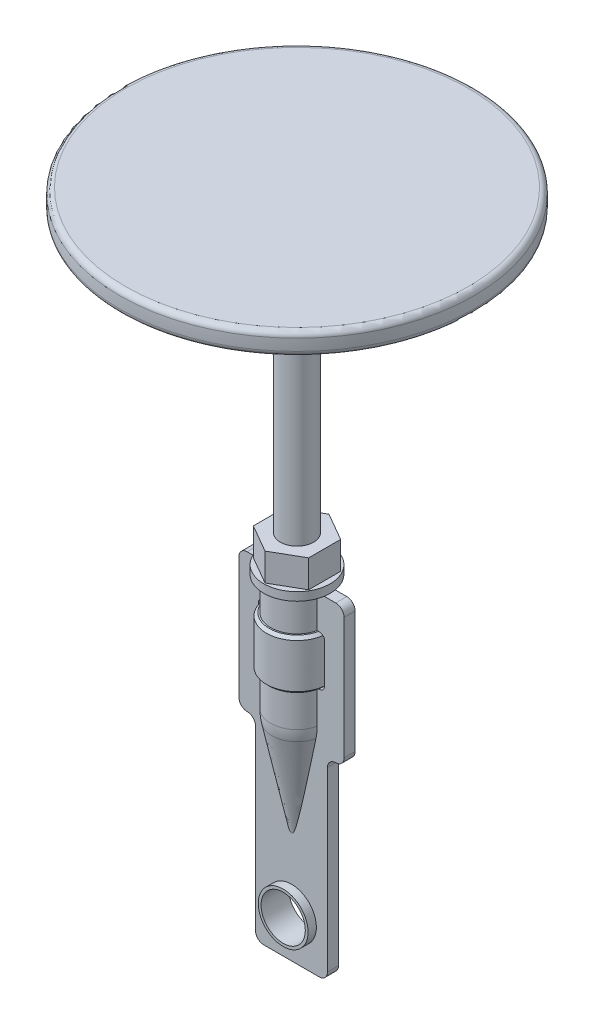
ISO-10303-21;
HEADER;
FILE_DESCRIPTION(('STEP AP214'),'2;1');
FILE_NAME('part.step','',(''),(''),'','','');
FILE_SCHEMA(('AUTOMOTIVE_DESIGN { 1 0 10303 214 1 1 1 1 }'));
ENDSEC;
DATA;
#1=APPLICATION_CONTEXT('core data for automotive mechanical design processes');
#2=APPLICATION_PROTOCOL_DEFINITION('international standard','automotive_design',2000,#1);
#3=PRODUCT_CONTEXT('',#1,'mechanical');
#4=PRODUCT('Part','Part','',(#3));
#5=PRODUCT_RELATED_PRODUCT_CATEGORY('part','',(#4));
#6=PRODUCT_DEFINITION_FORMATION('','',#4);
#7=PRODUCT_DEFINITION_CONTEXT('part definition',#1,'design');
#8=PRODUCT_DEFINITION('design','',#6,#7);
#9=PRODUCT_DEFINITION_SHAPE('','',#8);
#10=(LENGTH_UNIT() NAMED_UNIT(*) SI_UNIT(.MILLI.,.METRE.));
#11=(NAMED_UNIT(*) PLANE_ANGLE_UNIT() SI_UNIT($,.RADIAN.));
#12=(NAMED_UNIT(*) SI_UNIT($,.STERADIAN.) SOLID_ANGLE_UNIT());
#13=UNCERTAINTY_MEASURE_WITH_UNIT(LENGTH_MEASURE(1.E-05),#10,'distance_accuracy_value','');
#14=(GEOMETRIC_REPRESENTATION_CONTEXT(3) GLOBAL_UNCERTAINTY_ASSIGNED_CONTEXT((#13)) GLOBAL_UNIT_ASSIGNED_CONTEXT((#10,
#11,#12)) REPRESENTATION_CONTEXT('',''));
#15=CARTESIAN_POINT('',(0.,0.,0.));
#16=DIRECTION('',(0.,0.,1.));
#17=DIRECTION('',(1.,0.,0.));
#18=AXIS2_PLACEMENT_3D('',#15,#16,#17);
#19=CARTESIAN_POINT('',(0.,-83.5,1.));
#20=DIRECTION('',(0.,0.,-1.));
#21=DIRECTION('',(-1.,0.,0.));
#22=AXIS2_PLACEMENT_3D('',#19,#20,#21);
#23=PLANE('',#22);
#24=DIRECTION('',(0.,1.,0.));
#25=VECTOR('',#24,1.);
#26=CARTESIAN_POINT('',(-4.64354390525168,-58.5,1.));
#27=LINE('',#26,#25);
#28=CARTESIAN_POINT('',(-4.64354390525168,-58.5,1.));
#29=VERTEX_POINT('',#28);
#30=CARTESIAN_POINT('',(-4.64354390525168,-64.5,1.));
#31=VERTEX_POINT('',#30);
#32=EDGE_CURVE('E522',#29,#31,#27,.F.);
#33=ORIENTED_EDGE('',*,*,#32,.F.);
#34=DIRECTION('',(-1.,0.,0.));
#35=VECTOR('',#34,1.);
#36=CARTESIAN_POINT('',(0.,-58.5,1.));
#37=LINE('',#36,#35);
#38=CARTESIAN_POINT('',(-5.91607978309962,-58.5,1.));
#39=VERTEX_POINT('',#38);
#40=EDGE_CURVE('E874',#29,#39,#37,.T.);
#41=ORIENTED_EDGE('',*,*,#40,.T.);
#42=CARTESIAN_POINT('',(-8.,-58.5,1.));
#43=VERTEX_POINT('',#42);
#44=EDGE_CURVE('E870',#39,#43,#37,.T.);
#45=ORIENTED_EDGE('',*,*,#44,.T.);
#46=CARTESIAN_POINT('',(-8.,-60.,1.));
#47=DIRECTION('',(0.,0.,-1.));
#48=DIRECTION('',(-1.,0.,0.));
#49=AXIS2_PLACEMENT_3D('',#46,#47,#48);
#50=CIRCLE('',#49,1.5);
#51=CARTESIAN_POINT('',(-9.5,-60.,1.));
#52=VERTEX_POINT('',#51);
#53=EDGE_CURVE('E777',#43,#52,#50,.F.);
#54=ORIENTED_EDGE('',*,*,#53,.T.);
#55=DIRECTION('',(0.,-1.,0.));
#56=VECTOR('',#55,1.);
#57=CARTESIAN_POINT('',(-9.5,-58.5,1.));
#58=LINE('',#57,#56);
#59=CARTESIAN_POINT('',(-9.5,-82.,1.));
#60=VERTEX_POINT('',#59);
#61=EDGE_CURVE('E873',#52,#60,#58,.T.);
#62=ORIENTED_EDGE('',*,*,#61,.T.);
#63=CARTESIAN_POINT('',(-8.,-82.,1.));
#64=DIRECTION('',(0.,0.,-1.));
#65=DIRECTION('',(-1.,0.,0.));
#66=AXIS2_PLACEMENT_3D('',#63,#64,#65);
#67=CIRCLE('',#66,1.5);
#68=CARTESIAN_POINT('',(-8.,-83.5,1.));
#69=VERTEX_POINT('',#68);
#70=EDGE_CURVE('E781',#60,#69,#67,.F.);
#71=ORIENTED_EDGE('',*,*,#70,.T.);
#72=CARTESIAN_POINT('',(-7.99999999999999,-85.,1.));
#73=DIRECTION('',(0.,0.,-1.));
#74=DIRECTION('',(-1.,0.,0.));
#75=AXIS2_PLACEMENT_3D('',#72,#73,#74);
#76=CIRCLE('',#75,1.5);
#77=CARTESIAN_POINT('',(-6.49999999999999,-85.,1.));
#78=VERTEX_POINT('',#77);
#79=EDGE_CURVE('E632',#69,#78,#76,.T.);
#80=ORIENTED_EDGE('',*,*,#79,.T.);
#81=DIRECTION('',(0.,-1.,0.));
#82=VECTOR('',#81,1.);
#83=CARTESIAN_POINT('',(-6.49999999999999,-83.5,1.));
#84=LINE('',#83,#82);
#85=CARTESIAN_POINT('',(-6.49999999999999,-117.,1.));
#86=VERTEX_POINT('',#85);
#87=EDGE_CURVE('E876',#78,#86,#84,.T.);
#88=ORIENTED_EDGE('',*,*,#87,.T.);
#89=CARTESIAN_POINT('',(-4.99999999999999,-117.,1.));
#90=DIRECTION('',(0.,0.,-1.));
#91=DIRECTION('',(-1.,0.,0.));
#92=AXIS2_PLACEMENT_3D('',#89,#90,#91);
#93=CIRCLE('',#92,1.5);
#94=CARTESIAN_POINT('',(-4.99999999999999,-118.5,1.));
#95=VERTEX_POINT('',#94);
#96=EDGE_CURVE('E785',#86,#95,#93,.F.);
#97=ORIENTED_EDGE('',*,*,#96,.T.);
#98=DIRECTION('',(1.,0.,0.));
#99=VECTOR('',#98,1.);
#100=CARTESIAN_POINT('',(-6.49999999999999,-118.5,1.));
#101=LINE('',#100,#99);
#102=CARTESIAN_POINT('',(5.00000000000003,-118.5,1.));
#103=VERTEX_POINT('',#102);
#104=EDGE_CURVE('E675',#95,#103,#101,.T.);
#105=ORIENTED_EDGE('',*,*,#104,.T.);
#106=CARTESIAN_POINT('',(5.00000000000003,-117.,1.));
#107=DIRECTION('',(0.,0.,-1.));
#108=DIRECTION('',(-1.,0.,0.));
#109=AXIS2_PLACEMENT_3D('',#106,#107,#108);
#110=CIRCLE('',#109,1.5);
#111=CARTESIAN_POINT('',(6.50000000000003,-117.,1.));
#112=VERTEX_POINT('',#111);
#113=EDGE_CURVE('E787',#103,#112,#110,.F.);
#114=ORIENTED_EDGE('',*,*,#113,.T.);
#115=DIRECTION('',(0.,-1.,0.));
#116=VECTOR('',#115,1.);
#117=CARTESIAN_POINT('',(6.50000000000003,-83.5,1.));
#118=LINE('',#117,#116);
#119=CARTESIAN_POINT('',(6.50000000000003,-85.,1.));
#120=VERTEX_POINT('',#119);
#121=EDGE_CURVE('E662',#120,#112,#118,.T.);
#122=ORIENTED_EDGE('',*,*,#121,.F.);
#123=CARTESIAN_POINT('',(8.00000000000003,-85.,1.));
#124=DIRECTION('',(0.,0.,-1.));
#125=DIRECTION('',(-1.,0.,0.));
#126=AXIS2_PLACEMENT_3D('',#123,#124,#125);
#127=CIRCLE('',#126,1.5);
#128=CARTESIAN_POINT('',(8.00000000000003,-83.5,1.));
#129=VERTEX_POINT('',#128);
#130=EDGE_CURVE('E811',#120,#129,#127,.T.);
#131=ORIENTED_EDGE('',*,*,#130,.T.);
#132=CARTESIAN_POINT('',(8.00000000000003,-82.,1.));
#133=DIRECTION('',(0.,0.,-1.));
#134=DIRECTION('',(-1.,0.,0.));
#135=AXIS2_PLACEMENT_3D('',#132,#133,#134);
#136=CIRCLE('',#135,1.5);
#137=CARTESIAN_POINT('',(9.50000000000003,-82.,1.));
#138=VERTEX_POINT('',#137);
#139=EDGE_CURVE('E783',#129,#138,#136,.F.);
#140=ORIENTED_EDGE('',*,*,#139,.T.);
#141=DIRECTION('',(0.,-1.,0.));
#142=VECTOR('',#141,1.);
#143=CARTESIAN_POINT('',(9.50000000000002,-58.5,1.));
#144=LINE('',#143,#142);
#145=CARTESIAN_POINT('',(9.50000000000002,-60.,1.));
#146=VERTEX_POINT('',#145);
#147=EDGE_CURVE('E843',#146,#138,#144,.T.);
#148=ORIENTED_EDGE('',*,*,#147,.F.);
#149=CARTESIAN_POINT('',(8.00000000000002,-60.,1.));
#150=DIRECTION('',(0.,0.,-1.));
#151=DIRECTION('',(-1.,0.,0.));
#152=AXIS2_PLACEMENT_3D('',#149,#150,#151);
#153=CIRCLE('',#152,1.5);
#154=CARTESIAN_POINT('',(8.00000000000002,-58.5,1.));
#155=VERTEX_POINT('',#154);
#156=EDGE_CURVE('E779',#146,#155,#153,.F.);
#157=ORIENTED_EDGE('',*,*,#156,.T.);
#158=DIRECTION('',(1.,0.,0.));
#159=VECTOR('',#158,1.);
#160=CARTESIAN_POINT('',(0.,-58.5,1.));
#161=LINE('',#160,#159);
#162=CARTESIAN_POINT('',(5.91607978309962,-58.5,1.));
#163=VERTEX_POINT('',#162);
#164=EDGE_CURVE('E846',#163,#155,#161,.T.);
#165=ORIENTED_EDGE('',*,*,#164,.F.);
#166=CARTESIAN_POINT('',(4.64354390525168,-58.5,1.));
#167=VERTEX_POINT('',#166);
#168=EDGE_CURVE('E871',#163,#167,#37,.T.);
#169=ORIENTED_EDGE('',*,*,#168,.T.);
#170=DIRECTION('',(0.,1.,0.));
#171=VECTOR('',#170,1.);
#172=CARTESIAN_POINT('',(4.64354390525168,-58.5,1.));
#173=LINE('',#172,#171);
#174=CARTESIAN_POINT('',(4.64354390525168,-64.5,1.));
#175=VERTEX_POINT('',#174);
#176=EDGE_CURVE('E55',#175,#167,#173,.T.);
#177=ORIENTED_EDGE('',*,*,#176,.F.);
#178=DIRECTION('',(-1.,0.,0.));
#179=VECTOR('',#178,1.);
#180=CARTESIAN_POINT('',(0.,-64.5,1.));
#181=LINE('',#180,#179);
#182=CARTESIAN_POINT('',(4.89897948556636,-64.5,1.));
#183=VERTEX_POINT('',#182);
#184=EDGE_CURVE('E364',#183,#175,#181,.T.);
#185=ORIENTED_EDGE('',*,*,#184,.F.);
#186=DIRECTION('',(1.,0.,0.));
#187=VECTOR('',#186,1.);
#188=CARTESIAN_POINT('',(-6.,-64.5,1.));
#189=LINE('',#188,#187);
#190=CARTESIAN_POINT('',(5.00000000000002,-64.5,1.));
#191=VERTEX_POINT('',#190);
#192=EDGE_CURVE('E48',#183,#191,#189,.T.);
#193=ORIENTED_EDGE('',*,*,#192,.T.);
#194=CARTESIAN_POINT('',(5.00000000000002,-65.5,1.));
#195=DIRECTION('',(0.,0.,-1.));
#196=DIRECTION('',(-1.,0.,0.));
#197=AXIS2_PLACEMENT_3D('',#194,#195,#196);
#198=CIRCLE('',#197,1.);
#199=CARTESIAN_POINT('',(6.00000000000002,-65.5,1.));
#200=VERTEX_POINT('',#199);
#201=EDGE_CURVE('E623',#191,#200,#198,.T.);
#202=ORIENTED_EDGE('',*,*,#201,.T.);
#203=DIRECTION('',(0.,1.,0.));
#204=VECTOR('',#203,1.);
#205=CARTESIAN_POINT('',(6.00000000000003,-73.5,1.));
#206=LINE('',#205,#204);
#207=CARTESIAN_POINT('',(6.00000000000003,-72.5,1.));
#208=VERTEX_POINT('',#207);
#209=EDGE_CURVE('E655',#208,#200,#206,.T.);
#210=ORIENTED_EDGE('',*,*,#209,.F.);
#211=CARTESIAN_POINT('',(5.00000000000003,-72.5,1.));
#212=DIRECTION('',(0.,0.,-1.));
#213=DIRECTION('',(-1.,0.,0.));
#214=AXIS2_PLACEMENT_3D('',#211,#212,#213);
#215=CIRCLE('',#214,1.);
#216=CARTESIAN_POINT('',(5.00000000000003,-73.5,1.));
#217=VERTEX_POINT('',#216);
#218=EDGE_CURVE('E618',#208,#217,#215,.T.);
#219=ORIENTED_EDGE('',*,*,#218,.T.);
#220=DIRECTION('',(-1.,0.,0.));
#221=VECTOR('',#220,1.);
#222=CARTESIAN_POINT('',(0.,-73.5,1.));
#223=LINE('',#222,#221);
#224=CARTESIAN_POINT('',(4.89897948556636,-73.5,1.));
#225=VERTEX_POINT('',#224);
#226=EDGE_CURVE('E670',#217,#225,#223,.T.);
#227=ORIENTED_EDGE('',*,*,#226,.T.);
#228=DIRECTION('',(1.,0.,0.));
#229=VECTOR('',#228,1.);
#230=CARTESIAN_POINT('',(0.,-73.5,1.));
#231=LINE('',#230,#229);
#232=CARTESIAN_POINT('',(4.64354390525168,-73.5,1.));
#233=VERTEX_POINT('',#232);
#234=EDGE_CURVE('E369',#233,#225,#231,.T.);
#235=ORIENTED_EDGE('',*,*,#234,.F.);
#236=DIRECTION('',(0.,1.,0.));
#237=VECTOR('',#236,1.);
#238=CARTESIAN_POINT('',(4.64354390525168,-58.5,1.));
#239=LINE('',#238,#237);
#240=CARTESIAN_POINT('',(4.64354390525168,-79.4693973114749,1.));
#241=VERTEX_POINT('',#240);
#242=EDGE_CURVE('E1080',#241,#233,#239,.T.);
#243=ORIENTED_EDGE('',*,*,#242,.F.);
#244=CARTESIAN_POINT('',(0.,-87.2756448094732,1.));
#245=CARTESIAN_POINT('',(0.0368678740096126,-87.2756434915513,1.));
#246=CARTESIAN_POINT('',(0.0737435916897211,-87.2740025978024,1.));
#247=CARTESIAN_POINT('',(0.147220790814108,-87.267536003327,1.));
#248=CARTESIAN_POINT('',(0.183822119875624,-87.2627086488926,1.));
#249=CARTESIAN_POINT('',(0.293003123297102,-87.2437845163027,1.));
#250=CARTESIAN_POINT('',(0.36483119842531,-87.2252470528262,1.));
#251=CARTESIAN_POINT('',(0.497085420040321,-87.1820053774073,1.));
#252=CARTESIAN_POINT('',(0.557855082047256,-87.1582903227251,1.));
#253=CARTESIAN_POINT('',(0.677170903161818,-87.1057204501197,1.));
#254=CARTESIAN_POINT('',(0.73571485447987,-87.0768606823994,1.));
#255=CARTESIAN_POINT('',(0.850952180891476,-87.0151747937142,1.));
#256=CARTESIAN_POINT('',(0.907636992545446,-86.9823329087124,1.));
#257=CARTESIAN_POINT('',(1.01912841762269,-86.9136654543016,1.));
#258=CARTESIAN_POINT('',(1.07393563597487,-86.8778408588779,1.));
#259=CARTESIAN_POINT('',(1.20549267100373,-86.7876068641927,1.));
#260=CARTESIAN_POINT('',(1.28136321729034,-86.7319181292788,1.));
#261=CARTESIAN_POINT('',(1.43013174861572,-86.6166795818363,1.));
#262=CARTESIAN_POINT('',(1.50302857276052,-86.5571282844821,1.));
#263=CARTESIAN_POINT('',(1.64617979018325,-86.4347621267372,1.));
#264=CARTESIAN_POINT('',(1.71643079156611,-86.3719433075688,1.));
#265=CARTESIAN_POINT('',(1.85436271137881,-86.243538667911,1.));
#266=CARTESIAN_POINT('',(1.92204325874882,-86.1779524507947,1.));
#267=CARTESIAN_POINT('',(2.12156452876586,-85.9773288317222,1.));
#268=CARTESIAN_POINT('',(2.24970363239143,-85.8385836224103,1.));
#269=CARTESIAN_POINT('',(2.49630469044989,-85.5529670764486,1.));
#270=CARTESIAN_POINT('',(2.6147726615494,-85.4061008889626,1.));
#271=CARTESIAN_POINT('',(2.88703043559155,-85.0457820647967,1.));
#272=CARTESIAN_POINT('',(3.03632446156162,-84.8289119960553,1.));
#273=CARTESIAN_POINT('',(3.31605460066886,-84.3832375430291,1.));
#274=CARTESIAN_POINT('',(3.44648141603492,-84.1544273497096,1.));
#275=CARTESIAN_POINT('',(3.68774118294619,-83.6870865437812,1.));
#276=CARTESIAN_POINT('',(3.79859986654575,-83.448569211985,1.));
#277=CARTESIAN_POINT('',(4.00040351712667,-82.9633046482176,1.));
#278=CARTESIAN_POINT('',(4.09135148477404,-82.7165586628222,1.));
#279=CARTESIAN_POINT('',(4.25345674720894,-82.2147654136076,1.));
#280=CARTESIAN_POINT('',(4.32447287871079,-81.9596725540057,1.));
#281=CARTESIAN_POINT('',(4.44551379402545,-81.4444608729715,1.));
#282=CARTESIAN_POINT('',(4.49553106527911,-81.184340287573,1.));
#283=CARTESIAN_POINT('',(4.57426524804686,-80.6608752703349,1.));
#284=CARTESIAN_POINT('',(4.60298053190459,-80.3975305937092,1.));
#285=CARTESIAN_POINT('',(4.63895231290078,-79.8692622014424,1.));
#286=CARTESIAN_POINT('',(4.64619904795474,-79.6043378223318,1.));
#287=CARTESIAN_POINT('',(4.63904001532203,-79.0654292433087,1.));
#288=CARTESIAN_POINT('',(4.62386173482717,-78.7914549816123,1.));
#289=CARTESIAN_POINT('',(4.57053372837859,-78.2458715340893,1.));
#290=CARTESIAN_POINT('',(4.53239383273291,-77.974261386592,1.));
#291=CARTESIAN_POINT('',(4.43335263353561,-77.4350731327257,1.));
#292=CARTESIAN_POINT('',(4.37243938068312,-77.1674972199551,1.));
#293=CARTESIAN_POINT('',(4.22823868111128,-76.6385543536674,1.));
#294=CARTESIAN_POINT('',(4.14496008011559,-76.3771849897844,1.));
#295=CARTESIAN_POINT('',(3.95644846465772,-75.862356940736,1.));
#296=CARTESIAN_POINT('',(3.85120613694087,-75.6089016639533,1.));
#297=CARTESIAN_POINT('',(3.6193174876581,-75.1118964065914,1.));
#298=CARTESIAN_POINT('',(3.49266641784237,-74.8683486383,1.));
#299=CARTESIAN_POINT('',(3.21856612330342,-74.3932352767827,1.));
#300=CARTESIAN_POINT('',(3.07111583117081,-74.161670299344,1.));
#301=CARTESIAN_POINT('',(2.75599976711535,-73.7128470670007,1.));
#302=CARTESIAN_POINT('',(2.58834746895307,-73.4955794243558,1.));
#303=CARTESIAN_POINT('',(2.31960608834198,-73.1800145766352,1.));
#304=CARTESIAN_POINT('',(2.22591299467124,-73.0753561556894,1.));
#305=CARTESIAN_POINT('',(2.03310396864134,-72.8710998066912,1.));
#306=CARTESIAN_POINT('',(1.93398722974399,-72.7715026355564,1.));
#307=CARTESIAN_POINT('',(1.73042097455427,-72.5785467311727,1.));
#308=CARTESIAN_POINT('',(1.62598896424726,-72.4851695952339,1.));
#309=CARTESIAN_POINT('',(1.41104499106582,-72.3057795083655,1.));
#310=CARTESIAN_POINT('',(1.30053747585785,-72.2197612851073,1.));
#311=CARTESIAN_POINT('',(1.09876693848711,-72.0766126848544,1.));
#312=CARTESIAN_POINT('',(1.00899584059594,-72.017413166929,1.));
#313=CARTESIAN_POINT('',(0.870417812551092,-71.9350185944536,1.));
#314=CARTESIAN_POINT('',(0.823529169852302,-71.9086010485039,1.));
#315=CARTESIAN_POINT('',(0.72831990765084,-71.858465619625,1.));
#316=CARTESIAN_POINT('',(0.679999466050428,-71.8347474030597,1.));
#317=CARTESIAN_POINT('',(0.591128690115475,-71.7949114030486,1.));
#318=CARTESIAN_POINT('',(0.550843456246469,-71.7782053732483,1.));
#319=CARTESIAN_POINT('',(0.4692192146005,-71.7475389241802,1.));
#320=CARTESIAN_POINT('',(0.427880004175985,-71.7335790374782,1.));
#321=CARTESIAN_POINT('',(0.344396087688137,-71.7090488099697,1.));
#322=CARTESIAN_POINT('',(0.302255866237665,-71.698463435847,1.));
#323=CARTESIAN_POINT('',(0.217199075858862,-71.6811969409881,1.));
#324=CARTESIAN_POINT('',(0.174283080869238,-71.6745130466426,1.));
#325=CARTESIAN_POINT('',(0.0873627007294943,-71.6654463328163,1.));
#326=CARTESIAN_POINT('',(0.0433515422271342,-71.6631268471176,1.));
#327=CARTESIAN_POINT('',(-0.0446666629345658,-71.6631731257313,1.));
#328=CARTESIAN_POINT('',(-0.0886737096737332,-71.6655387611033,1.));
#329=CARTESIAN_POINT('',(-0.176337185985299,-71.67477317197,1.));
#330=CARTESIAN_POINT('',(-0.219992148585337,-71.6816555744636,1.));
#331=CARTESIAN_POINT('',(-0.306472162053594,-71.699437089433,1.));
#332=CARTESIAN_POINT('',(-0.34929693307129,-71.7103375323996,1.));
#333=CARTESIAN_POINT('',(-0.449907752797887,-71.7402855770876,1.));
#334=CARTESIAN_POINT('',(-0.507237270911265,-71.7608553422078,1.));
#335=CARTESIAN_POINT('',(-0.619882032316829,-71.8068894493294,1.));
#336=CARTESIAN_POINT('',(-0.6751960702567,-71.8323566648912,1.));
#337=CARTESIAN_POINT('',(-0.784155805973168,-71.887109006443,1.));
#338=CARTESIAN_POINT('',(-0.837793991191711,-71.916408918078,1.));
#339=CARTESIAN_POINT('',(-0.943351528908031,-71.9779049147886,1.));
#340=CARTESIAN_POINT('',(-0.995271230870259,-72.0101004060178,1.));
#341=CARTESIAN_POINT('',(-1.12045934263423,-72.0917228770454,1.));
#342=CARTESIAN_POINT('',(-1.19289793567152,-72.1424199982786,1.));
#343=CARTESIAN_POINT('',(-1.33502135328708,-72.247560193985,1.));
#344=CARTESIAN_POINT('',(-1.40470501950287,-72.3020048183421,1.));
#345=CARTESIAN_POINT('',(-1.54165212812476,-72.4140229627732,1.));
#346=CARTESIAN_POINT('',(-1.60891236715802,-72.4716003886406,1.));
#347=CARTESIAN_POINT('',(-1.74109654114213,-72.5893834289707,1.));
#348=CARTESIAN_POINT('',(-1.80602012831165,-72.6495894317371,1.));
#349=CARTESIAN_POINT('',(-1.99765757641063,-72.833868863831,1.));
#350=CARTESIAN_POINT('',(-2.12103496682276,-72.9614348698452,1.));
#351=CARTESIAN_POINT('',(-2.35917154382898,-73.2241467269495,1.));
#352=CARTESIAN_POINT('',(-2.47393642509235,-73.3592874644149,1.));
#353=CARTESIAN_POINT('',(-2.7468848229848,-73.7012100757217,1.));
#354=CARTESIAN_POINT('',(-2.90021623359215,-73.9118902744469,1.));
#355=CARTESIAN_POINT('',(-3.18855274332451,-74.3455442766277,1.));
#356=CARTESIAN_POINT('',(-3.3235476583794,-74.5685248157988,1.));
#357=CARTESIAN_POINT('',(-3.5744971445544,-75.0245647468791,1.));
#358=CARTESIAN_POINT('',(-3.69047683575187,-75.257610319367,1.));
#359=CARTESIAN_POINT('',(-3.90308833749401,-75.7323081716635,1.));
#360=CARTESIAN_POINT('',(-3.99972346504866,-75.9739589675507,1.));
#361=CARTESIAN_POINT('',(-4.17405660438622,-76.4666626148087,1.));
#362=CARTESIAN_POINT('',(-4.25155982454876,-76.7177843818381,1.));
#363=CARTESIAN_POINT('',(-4.38600803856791,-77.2255623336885,1.));
#364=CARTESIAN_POINT('',(-4.44294587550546,-77.4822204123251,1.));
#365=CARTESIAN_POINT('',(-4.53592054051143,-77.9993011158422,1.));
#366=CARTESIAN_POINT('',(-4.57195683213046,-78.2597238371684,1.));
#367=CARTESIAN_POINT('',(-4.62292964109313,-78.7826330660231,1.));
#368=CARTESIAN_POINT('',(-4.63786532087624,-79.0451196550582,1.));
#369=CARTESIAN_POINT('',(-4.64673211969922,-79.5814317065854,1.));
#370=CARTESIAN_POINT('',(-4.63975924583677,-79.8552725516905,1.));
#371=CARTESIAN_POINT('',(-4.60285948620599,-80.4014078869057,1.));
#372=CARTESIAN_POINT('',(-4.57293200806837,-80.6737023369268,1.));
#373=CARTESIAN_POINT('',(-4.49025292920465,-81.2151339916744,1.));
#374=CARTESIAN_POINT('',(-4.43747452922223,-81.4842671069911,1.));
#375=CARTESIAN_POINT('',(-4.30940187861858,-82.0171152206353,1.));
#376=CARTESIAN_POINT('',(-4.23410828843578,-82.2808303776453,1.));
#377=CARTESIAN_POINT('',(-4.06113934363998,-82.8018265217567,1.));
#378=CARTESIAN_POINT('',(-3.96338802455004,-83.0590823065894,1.));
#379=CARTESIAN_POINT('',(-3.7462274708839,-83.5641677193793,1.));
#380=CARTESIAN_POINT('',(-3.62682713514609,-83.8120011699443,1.));
#381=CARTESIAN_POINT('',(-3.36734682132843,-84.2955915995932,1.));
#382=CARTESIAN_POINT('',(-3.22733371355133,-84.5313844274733,1.));
#383=CARTESIAN_POINT('',(-2.92699122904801,-84.9894819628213,1.));
#384=CARTESIAN_POINT('',(-2.76667496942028,-85.2117952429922,1.));
#385=CARTESIAN_POINT('',(-2.46164162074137,-85.5956384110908,1.));
#386=CARTESIAN_POINT('',(-2.32068283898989,-85.7601512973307,1.));
#387=CARTESIAN_POINT('',(-2.09948993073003,-85.9982554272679,1.));
#388=CARTESIAN_POINT('',(-2.02401142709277,-86.0762908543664,1.));
#389=CARTESIAN_POINT('',(-1.86975377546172,-86.2290189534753,1.));
#390=CARTESIAN_POINT('',(-1.79097510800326,-86.3037121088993,1.));
#391=CARTESIAN_POINT('',(-1.62927641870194,-86.4498604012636,1.));
#392=CARTESIAN_POINT('',(-1.54632772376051,-86.5212839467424,1.));
#393=CARTESIAN_POINT('',(-1.37659505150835,-86.6593961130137,1.));
#394=CARTESIAN_POINT('',(-1.28981200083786,-86.7260858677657,1.));
#395=CARTESIAN_POINT('',(-1.11207575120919,-86.8532134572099,1.));
#396=CARTESIAN_POINT('',(-1.02113522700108,-86.9136686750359,1.));
#397=CARTESIAN_POINT('',(-0.880863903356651,-86.9977694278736,1.));
#398=CARTESIAN_POINT('',(-0.833502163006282,-87.0246873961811,1.));
#399=CARTESIAN_POINT('',(-0.737333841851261,-87.075791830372,1.));
#400=CARTESIAN_POINT('',(-0.688527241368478,-87.0999782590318,1.));
#401=CARTESIAN_POINT('',(-0.558950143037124,-87.1586560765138,1.));
#402=CARTESIAN_POINT('',(-0.476861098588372,-87.1904208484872,1.));
#403=CARTESIAN_POINT('',(-0.350934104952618,-87.22800147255,1.));
#404=CARTESIAN_POINT('',(-0.308587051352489,-87.2388380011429,1.));
#405=CARTESIAN_POINT('',(-0.223087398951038,-87.2565820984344,1.));
#406=CARTESIAN_POINT('',(-0.179935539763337,-87.2634931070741,1.));
#407=CARTESIAN_POINT('',(-0.113888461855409,-87.2706675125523,1.));
#408=CARTESIAN_POINT('',(-0.0911588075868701,-87.2725293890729,1.));
#409=CARTESIAN_POINT('',(-0.0456204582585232,-87.2750187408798,1.));
#410=CARTESIAN_POINT('',(-0.0228117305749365,-87.2756456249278,1.));
#411=CARTESIAN_POINT('',(0.,-87.2756448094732,1.));
#412=B_SPLINE_CURVE_WITH_KNOTS('',3,(#244,#245,#246,#247,#248,#249,#250,#251,#252,#253,#254,
#255,#256,#257,#258,#259,#260,#261,#262,#263,#264,#265,#266,#267,#268,#269,#270,#271,#272,#273,
#274,#275,#276,#277,#278,#279,#280,#281,#282,#283,#284,#285,#286,#287,#288,#289,#290,#291,#292,
#293,#294,#295,#296,#297,#298,#299,#300,#301,#302,#303,#304,#305,#306,#307,#308,#309,#310,#311,
#312,#313,#314,#315,#316,#317,#318,#319,#320,#321,#322,#323,#324,#325,#326,#327,#328,#329,#330,
#331,#332,#333,#334,#335,#336,#337,#338,#339,#340,#341,#342,#343,#344,#345,#346,#347,#348,#349,
#350,#351,#352,#353,#354,#355,#356,#357,#358,#359,#360,#361,#362,#363,#364,#365,#366,#367,#368,
#369,#370,#371,#372,#373,#374,#375,#376,#377,#378,#379,#380,#381,#382,#383,#384,#385,#386,#387,
#388,#389,#390,#391,#392,#393,#394,#395,#396,#397,#398,#399,#400,#401,#402,#403,#404,#405,#406,
#407,#408,#409,#410,#411),.UNSPECIFIED.,.T.,.F.,(4,2,2,2,2,2,2,2,2,2,2,2,2,2,2,2,2,2,2,2,2,2,2,
2,2,2,2,2,2,2,2,2,2,2,2,2,2,2,2,2,2,2,2,2,2,2,2,2,2,2,2,2,2,2,2,2,2,2,2,2,2,2,2,2,2,2,2,2,2,2,2,
2,2,2,2,2,2,2,2,2,2,2,2,4),(0.,0.110580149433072,0.221217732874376,0.442873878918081,
0.638303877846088,0.83392292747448,1.03034333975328,1.22669986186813,1.50887708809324,
1.79116343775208,2.07380014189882,2.3564774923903,2.92255003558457,3.48826768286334,
4.27709321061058,5.06630615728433,5.85447343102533,6.6425218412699,7.4360181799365,
8.22979815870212,9.02363878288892,9.81784032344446,10.6400466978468,11.4619013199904,
12.2841877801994,13.106149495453,13.9284604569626,14.7509540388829,15.5734898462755,
16.3954800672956,16.8167335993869,17.2380499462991,17.6580586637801,18.0777638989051,
18.3999837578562,18.5613740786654,18.7227444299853,18.8534993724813,18.98427964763,
19.1144688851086,19.2445654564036,19.3765357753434,19.5085024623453,19.6408691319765,
19.7732796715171,19.9556875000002,20.1382026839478,20.3214439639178,20.5046477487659,
20.7697338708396,21.0349302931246,21.3004652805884,21.5660396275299,22.0979788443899,
22.6295631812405,23.4102257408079,24.1913201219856,24.9713741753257,25.7512943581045,
26.5388550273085,27.3266895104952,28.1145442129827,28.9024301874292,29.7232464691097,
30.5440839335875,31.3658866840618,32.1876653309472,33.0122657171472,33.8365279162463,
34.6581727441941,35.4792894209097,36.1285412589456,36.4541549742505,36.7797214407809,
37.1079588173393,37.436117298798,37.763334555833,37.926686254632,38.0900401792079,
38.3531494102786,38.4841410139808,38.6150176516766,38.683405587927,38.7518262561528),.UNSPECIFIED.);
#413=CARTESIAN_POINT('',(4.42829788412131,-81.5089398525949,1.));
#414=VERTEX_POINT('',#413);
#415=EDGE_CURVE('E1082',#414,#241,#412,.T.);
#416=ORIENTED_EDGE('',*,*,#415,.F.);
#417=CARTESIAN_POINT('',(-9.50866319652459,-57.4067093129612,1.));
#418=CARTESIAN_POINT('',(-9.23845828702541,-58.696548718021,1.));
#419=CARTESIAN_POINT('',(-8.96814424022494,-59.9863652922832,1.));
#420=CARTESIAN_POINT('',(-8.42703056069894,-62.5667303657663,1.));
#421=CARTESIAN_POINT('',(-8.15623073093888,-63.8572788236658,1.));
#422=CARTESIAN_POINT('',(-7.74862306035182,-65.7982452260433,1.));
#423=CARTESIAN_POINT('',(-7.6119713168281,-66.448695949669,1.));
#424=CARTESIAN_POINT('',(-7.33854060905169,-67.7495756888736,1.));
#425=CARTESIAN_POINT('',(-7.20176164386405,-68.400004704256,1.));
#426=CARTESIAN_POINT('',(-6.9281381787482,-69.7004350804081,1.));
#427=CARTESIAN_POINT('',(-6.79129376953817,-70.3504364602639,1.));
#428=CARTESIAN_POINT('',(-6.51743025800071,-71.6503840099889,1.));
#429=CARTESIAN_POINT('',(-6.38041116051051,-72.3003301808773,1.));
#430=CARTESIAN_POINT('',(-6.02465810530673,-73.9864575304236,1.));
#431=CARTESIAN_POINT('',(-5.80575894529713,-75.0226038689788,1.));
#432=CARTESIAN_POINT('',(-5.36717615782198,-77.0948632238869,1.));
#433=CARTESIAN_POINT('',(-5.14749243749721,-78.1309762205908,1.));
#434=CARTESIAN_POINT('',(-4.70650657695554,-80.2054363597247,1.));
#435=CARTESIAN_POINT('',(-4.48520182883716,-81.243782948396,1.));
#436=CARTESIAN_POINT('',(-4.15201775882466,-82.8007862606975,1.));
#437=CARTESIAN_POINT('',(-4.04077810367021,-83.3195798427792,1.));
#438=CARTESIAN_POINT('',(-3.81775215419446,-84.3570376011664,1.));
#439=CARTESIAN_POINT('',(-3.70596587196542,-84.8757017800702,1.));
#440=CARTESIAN_POINT('',(-3.48260126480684,-85.9086108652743,1.));
#441=CARTESIAN_POINT('',(-3.37102879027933,-86.422857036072,1.));
#442=CARTESIAN_POINT('',(-3.1469358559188,-87.4511868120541,1.));
#443=CARTESIAN_POINT('',(-3.03441531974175,-87.96527040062,1.));
#444=CARTESIAN_POINT('',(-2.8078650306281,-88.9941020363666,1.));
#445=CARTESIAN_POINT('',(-2.69383287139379,-89.5088495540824,1.));
#446=CARTESIAN_POINT('',(-2.46392879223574,-90.5377754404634,1.));
#447=CARTESIAN_POINT('',(-2.34805742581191,-91.0519539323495,1.));
#448=CARTESIAN_POINT('',(-2.17241799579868,-91.8212342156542,1.));
#449=CARTESIAN_POINT('',(-2.11374059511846,-92.0765848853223,1.));
#450=CARTESIAN_POINT('',(-1.99546058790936,-92.5870819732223,1.));
#451=CARTESIAN_POINT('',(-1.93585794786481,-92.8422283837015,1.));
#452=CARTESIAN_POINT('',(-1.81538153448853,-93.3525218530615,1.));
#453=CARTESIAN_POINT('',(-1.75450641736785,-93.6076685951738,1.));
#454=CARTESIAN_POINT('',(-1.63113687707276,-94.1175372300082,1.));
#455=CARTESIAN_POINT('',(-1.5686426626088,-94.372259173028,1.));
#456=CARTESIAN_POINT('',(-1.44160358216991,-94.8801513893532,1.));
#457=CARTESIAN_POINT('',(-1.37706752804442,-95.1333238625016,1.));
#458=CARTESIAN_POINT('',(-1.24460535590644,-95.6389218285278,1.));
#459=CARTESIAN_POINT('',(-1.17667763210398,-95.8913469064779,1.));
#460=CARTESIAN_POINT('',(-1.07071328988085,-96.2685668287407,1.));
#461=CARTESIAN_POINT('',(-1.03475181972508,-96.3939432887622,1.));
#462=CARTESIAN_POINT('',(-0.960955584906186,-96.644168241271,1.));
#463=CARTESIAN_POINT('',(-0.923120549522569,-96.7690166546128,1.));
#464=CARTESIAN_POINT('',(-0.844867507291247,-97.0177865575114,1.));
#465=CARTESIAN_POINT('',(-0.804451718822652,-97.1417087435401,1.));
#466=CARTESIAN_POINT('',(-0.7197546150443,-97.388219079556,1.));
#467=CARTESIAN_POINT('',(-0.67547460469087,-97.5108076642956,1.));
#468=CARTESIAN_POINT('',(-0.620792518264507,-97.6503602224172,1.));
#469=CARTESIAN_POINT('',(-0.61357202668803,-97.6685708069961,1.));
#470=CARTESIAN_POINT('',(-0.598963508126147,-97.7049254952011,1.));
#471=CARTESIAN_POINT('',(-0.591575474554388,-97.7230695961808,1.));
#472=CARTESIAN_POINT('',(-0.569137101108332,-97.7773914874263,1.));
#473=CARTESIAN_POINT('',(-0.553813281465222,-97.8134568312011,1.));
#474=CARTESIAN_POINT('',(-0.522268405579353,-97.8852033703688,1.));
#475=CARTESIAN_POINT('',(-0.506047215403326,-97.920884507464,1.));
#476=CARTESIAN_POINT('',(-0.472473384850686,-97.9916995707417,1.));
#477=CARTESIAN_POINT('',(-0.455120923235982,-98.0268335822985,1.));
#478=CARTESIAN_POINT('',(-0.410008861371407,-98.113600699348,1.));
#479=CARTESIAN_POINT('',(-0.381350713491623,-98.1647889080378,1.));
#480=CARTESIAN_POINT('',(-0.334419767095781,-98.2391914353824,1.));
#481=CARTESIAN_POINT('',(-0.318094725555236,-98.2636262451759,1.));
#482=CARTESIAN_POINT('',(-0.28368965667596,-98.311215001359,1.));
#483=CARTESIAN_POINT('',(-0.265611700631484,-98.3343704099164,1.));
#484=CARTESIAN_POINT('',(-0.226805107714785,-98.3789413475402,1.));
#485=CARTESIAN_POINT('',(-0.206043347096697,-98.4003284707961,1.));
#486=CARTESIAN_POINT('',(-0.161182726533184,-98.4391870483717,1.));
#487=CARTESIAN_POINT('',(-0.137116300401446,-98.4566926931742,1.));
#488=CARTESIAN_POINT('',(-0.0995285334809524,-98.4765937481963,1.));
#489=CARTESIAN_POINT('',(-0.0876128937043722,-98.4819710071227,1.));
#490=CARTESIAN_POINT('',(-0.0630846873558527,-98.4908158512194,1.));
#491=CARTESIAN_POINT('',(-0.0504728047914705,-98.4942852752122,1.));
#492=CARTESIAN_POINT('',(-0.0247057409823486,-98.4989349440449,1.));
#493=CARTESIAN_POINT('',(-0.0115467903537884,-98.500095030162,1.));
#494=CARTESIAN_POINT('',(0.0147534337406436,-98.4998926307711,1.));
#495=CARTESIAN_POINT('',(0.0278947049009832,-98.4985298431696,1.));
#496=CARTESIAN_POINT('',(0.052453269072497,-98.4937280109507,1.));
#497=CARTESIAN_POINT('',(0.0639142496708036,-98.4905028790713,1.));
#498=CARTESIAN_POINT('',(0.0862596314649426,-98.482472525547,1.));
#499=CARTESIAN_POINT('',(0.0971437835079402,-98.4776666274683,1.));
#500=CARTESIAN_POINT('',(0.126551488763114,-98.4625545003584,1.));
#501=CARTESIAN_POINT('',(0.144371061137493,-98.450890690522,1.));
#502=CARTESIAN_POINT('',(0.178132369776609,-98.4251001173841,1.));
#503=CARTESIAN_POINT('',(0.194066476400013,-98.4109638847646,1.));
#504=CARTESIAN_POINT('',(0.230825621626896,-98.3748343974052,1.));
#505=CARTESIAN_POINT('',(0.2508618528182,-98.3520501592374,1.));
#506=CARTESIAN_POINT('',(0.288729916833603,-98.3046953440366,1.));
#507=CARTESIAN_POINT('',(0.306556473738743,-98.2801207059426,1.));
#508=CARTESIAN_POINT('',(0.340665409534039,-98.2297173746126,1.));
#509=CARTESIAN_POINT('',(0.356937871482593,-98.2038820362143,1.));
#510=CARTESIAN_POINT('',(0.38819421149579,-98.1514944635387,1.));
#511=CARTESIAN_POINT('',(0.403179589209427,-98.1249431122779,1.));
#512=CARTESIAN_POINT('',(0.44989369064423,-98.0385540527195,1.));
#513=CARTESIAN_POINT('',(0.479707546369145,-97.9776856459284,1.));
#514=CARTESIAN_POINT('',(0.536324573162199,-97.8545531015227,1.));
#515=CARTESIAN_POINT('',(0.56312545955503,-97.7922879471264,1.));
#516=CARTESIAN_POINT('',(0.61466775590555,-97.6667508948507,1.));
#517=CARTESIAN_POINT('',(0.63940439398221,-97.6034770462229,1.));
#518=CARTESIAN_POINT('',(0.687315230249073,-97.4763379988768,1.));
#519=CARTESIAN_POINT('',(0.710489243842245,-97.4124727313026,1.));
#520=CARTESIAN_POINT('',(0.778230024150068,-97.220268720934,1.));
#521=CARTESIAN_POINT('',(0.821021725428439,-97.0913060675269,1.));
#522=CARTESIAN_POINT('',(0.903529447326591,-96.8326248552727,1.));
#523=CARTESIAN_POINT('',(0.943249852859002,-96.7029076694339,1.));
#524=CARTESIAN_POINT('',(1.02022851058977,-96.4440296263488,1.));
#525=CARTESIAN_POINT('',(1.05750586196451,-96.3148744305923,1.));
#526=CARTESIAN_POINT('',(1.13053215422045,-96.0561326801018,1.));
#527=CARTESIAN_POINT('',(1.16628106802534,-95.9265461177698,1.));
#528=CARTESIAN_POINT('',(1.27180193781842,-95.5372923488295,1.));
#529=CARTESIAN_POINT('',(1.33984074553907,-95.2771561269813,1.));
#530=CARTESIAN_POINT('',(1.47306677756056,-94.7559244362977,1.));
#531=CARTESIAN_POINT('',(1.53825150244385,-94.49482833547,1.));
#532=CARTESIAN_POINT('',(1.66660475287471,-93.972156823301,1.));
#533=CARTESIAN_POINT('',(1.72977338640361,-93.7105814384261,1.));
#534=CARTESIAN_POINT('',(1.85452085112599,-93.1876753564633,1.));
#535=CARTESIAN_POINT('',(1.91610294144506,-92.9263454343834,1.));
#536=CARTESIAN_POINT('',(2.03818486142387,-92.4034295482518,1.));
#537=CARTESIAN_POINT('',(2.0986846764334,-92.1418435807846,1.));
#538=CARTESIAN_POINT('',(2.21882599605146,-91.618578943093,1.));
#539=CARTESIAN_POINT('',(2.27846781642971,-91.3569003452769,1.));
#540=CARTESIAN_POINT('',(2.39708964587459,-90.8333946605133,1.));
#541=CARTESIAN_POINT('',(2.4560696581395,-90.57156757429,1.));
#542=CARTESIAN_POINT('',(2.63201952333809,-89.7867965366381,1.));
#543=CARTESIAN_POINT('',(2.74820177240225,-89.2636760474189,1.));
#544=CARTESIAN_POINT('',(2.97913901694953,-88.2171198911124,1.));
#545=CARTESIAN_POINT('',(3.09389400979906,-87.6936842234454,1.));
#546=CARTESIAN_POINT('',(3.43665373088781,-86.1230416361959,1.));
#547=CARTESIAN_POINT('',(3.66315165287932,-85.0755061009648,1.));
#548=CARTESIAN_POINT('',(4.11395440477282,-82.9797530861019,1.));
#549=CARTESIAN_POINT('',(4.33825880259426,-81.9315355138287,1.));
#550=CARTESIAN_POINT('',(4.7854503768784,-79.8348021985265,1.));
#551=CARTESIAN_POINT('',(5.00833755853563,-78.7862864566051,1.));
#552=CARTESIAN_POINT('',(5.45384114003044,-76.6858982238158,1.));
#553=CARTESIAN_POINT('',(5.67645470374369,-75.6340251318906,1.));
#554=CARTESIAN_POINT('',(6.12101779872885,-73.5301373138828,1.));
#555=CARTESIAN_POINT('',(6.34296732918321,-72.4781225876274,1.));
#556=CARTESIAN_POINT('',(6.78633631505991,-70.3742243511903,1.));
#557=CARTESIAN_POINT('',(7.00775587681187,-69.3223408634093,1.));
#558=CARTESIAN_POINT('',(7.45022633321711,-67.2184979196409,1.));
#559=CARTESIAN_POINT('',(7.67127722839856,-66.1665384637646,1.));
#560=CARTESIAN_POINT('',(7.89220020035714,-65.1145521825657,1.));
#561=B_SPLINE_CURVE_WITH_KNOTS('',3,(#417,#418,#419,#420,#421,#422,#423,#424,#425,#426,#427,
#428,#429,#430,#431,#432,#433,#434,#435,#436,#437,#438,#439,#440,#441,#442,#443,#444,#445,#446,
#447,#448,#449,#450,#451,#452,#453,#454,#455,#456,#457,#458,#459,#460,#461,#462,#463,#464,#465,
#466,#467,#468,#469,#470,#471,#472,#473,#474,#475,#476,#477,#478,#479,#480,#481,#482,#483,#484,
#485,#486,#487,#488,#489,#490,#491,#492,#493,#494,#495,#496,#497,#498,#499,#500,#501,#502,#503,
#504,#505,#506,#507,#508,#509,#510,#511,#512,#513,#514,#515,#516,#517,#518,#519,#520,#521,#522,
#523,#524,#525,#526,#527,#528,#529,#530,#531,#532,#533,#534,#535,#536,#537,#538,#539,#540,#541,
#542,#543,#544,#545,#546,#547,#548,#549,#550,#551,#552,#553,#554,#555,#556,#557,#558,#559,#560),
.UNSPECIFIED.,.F.,.F.,(4,2,2,2,2,2,2,2,2,2,2,2,2,2,2,2,2,2,2,2,2,2,2,2,2,2,2,2,2,2,2,2,2,2,2,2,
2,2,2,2,2,2,2,2,2,2,2,2,2,2,2,2,2,2,2,2,2,2,2,2,2,2,2,2,2,2,2,2,2,2,2,4),(0.,3.95351335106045,
7.90947473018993,9.90342521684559,11.8973904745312,13.8901407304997,15.8828369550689,
19.0598864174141,22.2373252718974,25.4223288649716,27.0140853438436,28.6058067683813,
30.184437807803,31.7631972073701,33.3448763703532,34.9260882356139,35.7121041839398,
36.4981486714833,37.2850699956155,38.0718903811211,38.8556844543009,39.6398532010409,
40.0311397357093,40.4224829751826,40.8134942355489,41.2043739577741,41.2631426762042,
41.3219137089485,41.4394623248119,41.5570285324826,41.674576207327,41.8503307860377,
41.9384404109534,42.0264471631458,42.1156678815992,42.2040683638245,42.2431606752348,
42.2822152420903,42.3216092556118,42.3610079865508,42.3965902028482,42.4321876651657,
42.4957058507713,42.5594728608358,42.6502622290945,42.7412643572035,42.832813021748,
42.9242535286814,43.1274242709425,43.3307480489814,43.5345295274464,43.7383350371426,
44.1458954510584,44.5528628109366,44.9561307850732,45.3594059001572,46.1660344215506,
46.9733557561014,47.7806337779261,48.5860942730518,49.3915656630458,50.1967326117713,
51.0018956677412,52.6094929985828,54.21709329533,57.4323153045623,60.6481583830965,
63.8639896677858,67.0895039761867,70.3150222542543,73.5398275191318,76.7646281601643),.UNSPECIFIED.);
#562=CARTESIAN_POINT('',(-4.42829788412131,-81.5089398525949,1.));
#563=VERTEX_POINT('',#562);
#564=EDGE_CURVE('E372',#563,#414,#561,.T.);
#565=ORIENTED_EDGE('',*,*,#564,.F.);
#566=CARTESIAN_POINT('',(-4.64354390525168,-79.4693973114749,1.));
#567=VERTEX_POINT('',#566);
#568=EDGE_CURVE('E379',#567,#563,#412,.T.);
#569=ORIENTED_EDGE('',*,*,#568,.F.);
#570=DIRECTION('',(0.,1.,0.));
#571=VECTOR('',#570,1.);
#572=CARTESIAN_POINT('',(-4.64354390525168,-58.5,1.));
#573=LINE('',#572,#571);
#574=CARTESIAN_POINT('',(-4.64354390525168,-73.5,1.));
#575=VERTEX_POINT('',#574);
#576=EDGE_CURVE('E1083',#575,#567,#573,.F.);
#577=ORIENTED_EDGE('',*,*,#576,.F.);
#578=CARTESIAN_POINT('',(-4.89897948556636,-73.5,1.));
#579=VERTEX_POINT('',#578);
#580=EDGE_CURVE('E371',#579,#575,#231,.T.);
#581=ORIENTED_EDGE('',*,*,#580,.F.);
#582=CARTESIAN_POINT('',(-5.,-73.5,1.));
#583=VERTEX_POINT('',#582);
#584=EDGE_CURVE('E672',#579,#583,#223,.T.);
#585=ORIENTED_EDGE('',*,*,#584,.T.);
#586=CARTESIAN_POINT('',(-5.,-72.5,1.));
#587=DIRECTION('',(0.,0.,-1.));
#588=DIRECTION('',(-1.,0.,0.));
#589=AXIS2_PLACEMENT_3D('',#586,#587,#588);
#590=CIRCLE('',#589,1.);
#591=CARTESIAN_POINT('',(-6.,-72.5,1.));
#592=VERTEX_POINT('',#591);
#593=EDGE_CURVE('E614',#583,#592,#590,.T.);
#594=ORIENTED_EDGE('',*,*,#593,.T.);
#595=DIRECTION('',(0.,1.,0.));
#596=VECTOR('',#595,1.);
#597=CARTESIAN_POINT('',(-6.,-73.5,1.));
#598=LINE('',#597,#596);
#599=CARTESIAN_POINT('',(-6.,-65.5,1.));
#600=VERTEX_POINT('',#599);
#601=EDGE_CURVE('E628',#592,#600,#598,.T.);
#602=ORIENTED_EDGE('',*,*,#601,.T.);
#603=CARTESIAN_POINT('',(-5.,-65.5,1.));
#604=DIRECTION('',(0.,0.,-1.));
#605=DIRECTION('',(-1.,0.,0.));
#606=AXIS2_PLACEMENT_3D('',#603,#604,#605);
#607=CIRCLE('',#606,1.);
#608=CARTESIAN_POINT('',(-5.,-64.5,1.));
#609=VERTEX_POINT('',#608);
#610=EDGE_CURVE('E409',#600,#609,#607,.T.);
#611=ORIENTED_EDGE('',*,*,#610,.T.);
#612=CARTESIAN_POINT('',(-4.89897948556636,-64.5,1.));
#613=VERTEX_POINT('',#612);
#614=EDGE_CURVE('E604',#609,#613,#189,.T.);
#615=ORIENTED_EDGE('',*,*,#614,.T.);
#616=EDGE_CURVE('E361',#31,#613,#181,.T.);
#617=ORIENTED_EDGE('',*,*,#616,.F.);
#618=EDGE_LOOP('',(#33,#41,#45,#54,#62,#71,#80,#88,#97,#105,#114,#122,#131,#140,#148,#157,#165,
#169,#177,#185,#193,#202,#210,#219,#227,#235,#243,#416,#565,#569,#577,#581,#585,#594,#602,#611,
#615,#617));
#619=FACE_BOUND('',#618,.T.);
#620=CARTESIAN_POINT('',(0.,-111.,1.));
#621=DIRECTION('',(0.,0.,-1.));
#622=DIRECTION('',(-1.,0.,0.));
#623=AXIS2_PLACEMENT_3D('',#620,#621,#622);
#624=CIRCLE('',#623,4.5);
#625=CARTESIAN_POINT('',(-4.5,-111.,1.));
#626=VERTEX_POINT('',#625);
#627=EDGE_CURVE('E11',#626,#626,#624,.F.);
#628=ORIENTED_EDGE('',*,*,#627,.F.);
#629=EDGE_LOOP('',(#628));
#630=FACE_BOUND('',#629,.T.);
#631=ADVANCED_FACE('F31',(#619,#630),#23,.F.);
#632=CARTESIAN_POINT('',(0.,-83.5,-1.));
#633=DIRECTION('',(0.,0.,-1.));
#634=DIRECTION('',(-1.,0.,0.));
#635=AXIS2_PLACEMENT_3D('',#632,#633,#634);
#636=PLANE('',#635);
#637=DIRECTION('',(-1.,0.,0.));
#638=VECTOR('',#637,1.);
#639=CARTESIAN_POINT('',(0.,-58.5,-1.));
#640=LINE('',#639,#638);
#641=CARTESIAN_POINT('',(-4.64354390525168,-58.5,-1.));
#642=VERTEX_POINT('',#641);
#643=CARTESIAN_POINT('',(-5.91607978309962,-58.5,-1.));
#644=VERTEX_POINT('',#643);
#645=EDGE_CURVE('E334',#642,#644,#640,.T.);
#646=ORIENTED_EDGE('',*,*,#645,.F.);
#647=DIRECTION('',(0.,1.,0.));
#648=VECTOR('',#647,1.);
#649=CARTESIAN_POINT('',(-4.64354390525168,-58.5,-1.));
#650=LINE('',#649,#648);
#651=CARTESIAN_POINT('',(-4.64354390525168,-64.5,-1.));
#652=VERTEX_POINT('',#651);
#653=EDGE_CURVE('E40',#642,#652,#650,.F.);
#654=ORIENTED_EDGE('',*,*,#653,.T.);
#655=DIRECTION('',(-1.,0.,0.));
#656=VECTOR('',#655,1.);
#657=CARTESIAN_POINT('',(0.,-64.5,-1.));
#658=LINE('',#657,#656);
#659=CARTESIAN_POINT('',(-4.89897948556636,-64.5,-1.));
#660=VERTEX_POINT('',#659);
#661=EDGE_CURVE('E331',#652,#660,#658,.T.);
#662=ORIENTED_EDGE('',*,*,#661,.T.);
#663=DIRECTION('',(1.,0.,0.));
#664=VECTOR('',#663,1.);
#665=CARTESIAN_POINT('',(-6.,-64.5,-1.));
#666=LINE('',#665,#664);
#667=CARTESIAN_POINT('',(-5.,-64.5,-1.));
#668=VERTEX_POINT('',#667);
#669=EDGE_CURVE('E590',#668,#660,#666,.T.);
#670=ORIENTED_EDGE('',*,*,#669,.F.);
#671=CARTESIAN_POINT('',(-5.,-65.5,-1.));
#672=DIRECTION('',(0.,0.,-1.));
#673=DIRECTION('',(-1.,0.,0.));
#674=AXIS2_PLACEMENT_3D('',#671,#672,#673);
#675=CIRCLE('',#674,1.);
#676=CARTESIAN_POINT('',(-6.,-65.5,-1.));
#677=VERTEX_POINT('',#676);
#678=EDGE_CURVE('E597',#668,#677,#675,.F.);
#679=ORIENTED_EDGE('',*,*,#678,.T.);
#680=DIRECTION('',(0.,1.,0.));
#681=VECTOR('',#680,1.);
#682=CARTESIAN_POINT('',(-6.,-73.5,-1.));
#683=LINE('',#682,#681);
#684=CARTESIAN_POINT('',(-6.,-72.5,-1.));
#685=VERTEX_POINT('',#684);
#686=EDGE_CURVE('E866',#685,#677,#683,.T.);
#687=ORIENTED_EDGE('',*,*,#686,.F.);
#688=CARTESIAN_POINT('',(-5.,-72.5,-1.));
#689=DIRECTION('',(0.,0.,-1.));
#690=DIRECTION('',(-1.,0.,0.));
#691=AXIS2_PLACEMENT_3D('',#688,#689,#690);
#692=CIRCLE('',#691,1.);
#693=CARTESIAN_POINT('',(-5.,-73.5,-1.));
#694=VERTEX_POINT('',#693);
#695=EDGE_CURVE('E611',#685,#694,#692,.F.);
#696=ORIENTED_EDGE('',*,*,#695,.T.);
#697=DIRECTION('',(-1.,0.,0.));
#698=VECTOR('',#697,1.);
#699=CARTESIAN_POINT('',(0.,-73.5,-1.));
#700=LINE('',#699,#698);
#701=CARTESIAN_POINT('',(-4.89897948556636,-73.5,-1.));
#702=VERTEX_POINT('',#701);
#703=EDGE_CURVE('E862',#702,#694,#700,.T.);
#704=ORIENTED_EDGE('',*,*,#703,.F.);
#705=DIRECTION('',(1.,0.,0.));
#706=VECTOR('',#705,1.);
#707=CARTESIAN_POINT('',(0.,-73.5,-1.));
#708=LINE('',#707,#706);
#709=CARTESIAN_POINT('',(-4.64354390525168,-73.5,-1.));
#710=VERTEX_POINT('',#709);
#711=EDGE_CURVE('E368',#702,#710,#708,.T.);
#712=ORIENTED_EDGE('',*,*,#711,.T.);
#713=DIRECTION('',(0.,1.,0.));
#714=VECTOR('',#713,1.);
#715=CARTESIAN_POINT('',(-4.64354390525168,-58.5,-1.));
#716=LINE('',#715,#714);
#717=CARTESIAN_POINT('',(-4.64354390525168,-79.4693973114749,-1.));
#718=VERTEX_POINT('',#717);
#719=EDGE_CURVE('E1065',#710,#718,#716,.F.);
#720=ORIENTED_EDGE('',*,*,#719,.T.);
#721=CARTESIAN_POINT('',(0.,-87.2756448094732,-1.));
#722=CARTESIAN_POINT('',(0.0368678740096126,-87.2756434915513,-1.));
#723=CARTESIAN_POINT('',(0.0737435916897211,-87.2740025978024,-1.));
#724=CARTESIAN_POINT('',(0.147220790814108,-87.267536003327,-1.));
#725=CARTESIAN_POINT('',(0.183822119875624,-87.2627086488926,-1.));
#726=CARTESIAN_POINT('',(0.293003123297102,-87.2437845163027,-1.));
#727=CARTESIAN_POINT('',(0.36483119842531,-87.2252470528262,-1.));
#728=CARTESIAN_POINT('',(0.497085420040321,-87.1820053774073,-1.));
#729=CARTESIAN_POINT('',(0.557855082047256,-87.1582903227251,-1.));
#730=CARTESIAN_POINT('',(0.677170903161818,-87.1057204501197,-1.));
#731=CARTESIAN_POINT('',(0.73571485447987,-87.0768606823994,-1.));
#732=CARTESIAN_POINT('',(0.850952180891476,-87.0151747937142,-1.));
#733=CARTESIAN_POINT('',(0.907636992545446,-86.9823329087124,-1.));
#734=CARTESIAN_POINT('',(1.01912841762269,-86.9136654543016,-1.));
#735=CARTESIAN_POINT('',(1.07393563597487,-86.8778408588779,-1.));
#736=CARTESIAN_POINT('',(1.20549267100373,-86.7876068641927,-1.));
#737=CARTESIAN_POINT('',(1.28136321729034,-86.7319181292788,-1.));
#738=CARTESIAN_POINT('',(1.43013174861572,-86.6166795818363,-1.));
#739=CARTESIAN_POINT('',(1.50302857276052,-86.5571282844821,-1.));
#740=CARTESIAN_POINT('',(1.64617979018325,-86.4347621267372,-1.));
#741=CARTESIAN_POINT('',(1.71643079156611,-86.3719433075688,-1.));
#742=CARTESIAN_POINT('',(1.85436271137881,-86.243538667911,-1.));
#743=CARTESIAN_POINT('',(1.92204325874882,-86.1779524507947,-1.));
#744=CARTESIAN_POINT('',(2.12156452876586,-85.9773288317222,-1.));
#745=CARTESIAN_POINT('',(2.24970363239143,-85.8385836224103,-1.));
#746=CARTESIAN_POINT('',(2.49630469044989,-85.5529670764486,-1.));
#747=CARTESIAN_POINT('',(2.6147726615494,-85.4061008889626,-1.));
#748=CARTESIAN_POINT('',(2.88703043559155,-85.0457820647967,-1.));
#749=CARTESIAN_POINT('',(3.03632446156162,-84.8289119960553,-1.));
#750=CARTESIAN_POINT('',(3.31605460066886,-84.3832375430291,-1.));
#751=CARTESIAN_POINT('',(3.44648141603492,-84.1544273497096,-1.));
#752=CARTESIAN_POINT('',(3.68774118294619,-83.6870865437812,-1.));
#753=CARTESIAN_POINT('',(3.79859986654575,-83.448569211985,-1.));
#754=CARTESIAN_POINT('',(4.00040351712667,-82.9633046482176,-1.));
#755=CARTESIAN_POINT('',(4.09135148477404,-82.7165586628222,-1.));
#756=CARTESIAN_POINT('',(4.25345674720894,-82.2147654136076,-1.));
#757=CARTESIAN_POINT('',(4.32447287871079,-81.9596725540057,-1.));
#758=CARTESIAN_POINT('',(4.44551379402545,-81.4444608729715,-1.));
#759=CARTESIAN_POINT('',(4.49553106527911,-81.184340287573,-1.));
#760=CARTESIAN_POINT('',(4.57426524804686,-80.6608752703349,-1.));
#761=CARTESIAN_POINT('',(4.60298053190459,-80.3975305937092,-1.));
#762=CARTESIAN_POINT('',(4.63895231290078,-79.8692622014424,-1.));
#763=CARTESIAN_POINT('',(4.64619904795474,-79.6043378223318,-1.));
#764=CARTESIAN_POINT('',(4.63904001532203,-79.0654292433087,-1.));
#765=CARTESIAN_POINT('',(4.62386173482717,-78.7914549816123,-1.));
#766=CARTESIAN_POINT('',(4.57053372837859,-78.2458715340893,-1.));
#767=CARTESIAN_POINT('',(4.53239383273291,-77.974261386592,-1.));
#768=CARTESIAN_POINT('',(4.43335263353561,-77.4350731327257,-1.));
#769=CARTESIAN_POINT('',(4.37243938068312,-77.1674972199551,-1.));
#770=CARTESIAN_POINT('',(4.22823868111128,-76.6385543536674,-1.));
#771=CARTESIAN_POINT('',(4.14496008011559,-76.3771849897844,-1.));
#772=CARTESIAN_POINT('',(3.95644846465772,-75.862356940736,-1.));
#773=CARTESIAN_POINT('',(3.85120613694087,-75.6089016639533,-1.));
#774=CARTESIAN_POINT('',(3.6193174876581,-75.1118964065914,-1.));
#775=CARTESIAN_POINT('',(3.49266641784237,-74.8683486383,-1.));
#776=CARTESIAN_POINT('',(3.21856612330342,-74.3932352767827,-1.));
#777=CARTESIAN_POINT('',(3.07111583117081,-74.161670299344,-1.));
#778=CARTESIAN_POINT('',(2.75599976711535,-73.7128470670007,-1.));
#779=CARTESIAN_POINT('',(2.58834746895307,-73.4955794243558,-1.));
#780=CARTESIAN_POINT('',(2.31960608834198,-73.1800145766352,-1.));
#781=CARTESIAN_POINT('',(2.22591299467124,-73.0753561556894,-1.));
#782=CARTESIAN_POINT('',(2.03310396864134,-72.8710998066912,-1.));
#783=CARTESIAN_POINT('',(1.93398722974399,-72.7715026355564,-1.));
#784=CARTESIAN_POINT('',(1.73042097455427,-72.5785467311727,-1.));
#785=CARTESIAN_POINT('',(1.62598896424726,-72.4851695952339,-1.));
#786=CARTESIAN_POINT('',(1.41104499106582,-72.3057795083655,-1.));
#787=CARTESIAN_POINT('',(1.30053747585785,-72.2197612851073,-1.));
#788=CARTESIAN_POINT('',(1.09876693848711,-72.0766126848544,-1.));
#789=CARTESIAN_POINT('',(1.00899584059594,-72.017413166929,-1.));
#790=CARTESIAN_POINT('',(0.870417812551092,-71.9350185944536,-1.));
#791=CARTESIAN_POINT('',(0.823529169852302,-71.9086010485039,-1.));
#792=CARTESIAN_POINT('',(0.72831990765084,-71.858465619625,-1.));
#793=CARTESIAN_POINT('',(0.679999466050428,-71.8347474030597,-1.));
#794=CARTESIAN_POINT('',(0.591128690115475,-71.7949114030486,-1.));
#795=CARTESIAN_POINT('',(0.550843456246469,-71.7782053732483,-1.));
#796=CARTESIAN_POINT('',(0.4692192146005,-71.7475389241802,-1.));
#797=CARTESIAN_POINT('',(0.427880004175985,-71.7335790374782,-1.));
#798=CARTESIAN_POINT('',(0.344396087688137,-71.7090488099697,-1.));
#799=CARTESIAN_POINT('',(0.302255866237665,-71.698463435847,-1.));
#800=CARTESIAN_POINT('',(0.217199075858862,-71.6811969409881,-1.));
#801=CARTESIAN_POINT('',(0.174283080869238,-71.6745130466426,-1.));
#802=CARTESIAN_POINT('',(0.0873627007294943,-71.6654463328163,-1.));
#803=CARTESIAN_POINT('',(0.0433515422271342,-71.6631268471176,-1.));
#804=CARTESIAN_POINT('',(-0.0446666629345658,-71.6631731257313,-1.));
#805=CARTESIAN_POINT('',(-0.0886737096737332,-71.6655387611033,-1.));
#806=CARTESIAN_POINT('',(-0.176337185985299,-71.67477317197,-1.));
#807=CARTESIAN_POINT('',(-0.219992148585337,-71.6816555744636,-1.));
#808=CARTESIAN_POINT('',(-0.306472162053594,-71.699437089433,-1.));
#809=CARTESIAN_POINT('',(-0.34929693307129,-71.7103375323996,-1.));
#810=CARTESIAN_POINT('',(-0.449907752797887,-71.7402855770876,-1.));
#811=CARTESIAN_POINT('',(-0.507237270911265,-71.7608553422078,-1.));
#812=CARTESIAN_POINT('',(-0.619882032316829,-71.8068894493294,-1.));
#813=CARTESIAN_POINT('',(-0.6751960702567,-71.8323566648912,-1.));
#814=CARTESIAN_POINT('',(-0.784155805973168,-71.887109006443,-1.));
#815=CARTESIAN_POINT('',(-0.837793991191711,-71.916408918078,-1.));
#816=CARTESIAN_POINT('',(-0.943351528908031,-71.9779049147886,-1.));
#817=CARTESIAN_POINT('',(-0.995271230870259,-72.0101004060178,-1.));
#818=CARTESIAN_POINT('',(-1.12045934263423,-72.0917228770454,-1.));
#819=CARTESIAN_POINT('',(-1.19289793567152,-72.1424199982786,-1.));
#820=CARTESIAN_POINT('',(-1.33502135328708,-72.247560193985,-1.));
#821=CARTESIAN_POINT('',(-1.40470501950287,-72.3020048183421,-1.));
#822=CARTESIAN_POINT('',(-1.54165212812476,-72.4140229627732,-1.));
#823=CARTESIAN_POINT('',(-1.60891236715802,-72.4716003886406,-1.));
#824=CARTESIAN_POINT('',(-1.74109654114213,-72.5893834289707,-1.));
#825=CARTESIAN_POINT('',(-1.80602012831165,-72.6495894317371,-1.));
#826=CARTESIAN_POINT('',(-1.99765757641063,-72.833868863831,-1.));
#827=CARTESIAN_POINT('',(-2.12103496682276,-72.9614348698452,-1.));
#828=CARTESIAN_POINT('',(-2.35917154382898,-73.2241467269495,-1.));
#829=CARTESIAN_POINT('',(-2.47393642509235,-73.3592874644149,-1.));
#830=CARTESIAN_POINT('',(-2.7468848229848,-73.7012100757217,-1.));
#831=CARTESIAN_POINT('',(-2.90021623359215,-73.9118902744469,-1.));
#832=CARTESIAN_POINT('',(-3.18855274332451,-74.3455442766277,-1.));
#833=CARTESIAN_POINT('',(-3.3235476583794,-74.5685248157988,-1.));
#834=CARTESIAN_POINT('',(-3.5744971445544,-75.0245647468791,-1.));
#835=CARTESIAN_POINT('',(-3.69047683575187,-75.257610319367,-1.));
#836=CARTESIAN_POINT('',(-3.90308833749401,-75.7323081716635,-1.));
#837=CARTESIAN_POINT('',(-3.99972346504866,-75.9739589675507,-1.));
#838=CARTESIAN_POINT('',(-4.17405660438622,-76.4666626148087,-1.));
#839=CARTESIAN_POINT('',(-4.25155982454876,-76.7177843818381,-1.));
#840=CARTESIAN_POINT('',(-4.38600803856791,-77.2255623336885,-1.));
#841=CARTESIAN_POINT('',(-4.44294587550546,-77.4822204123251,-1.));
#842=CARTESIAN_POINT('',(-4.53592054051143,-77.9993011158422,-1.));
#843=CARTESIAN_POINT('',(-4.57195683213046,-78.2597238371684,-1.));
#844=CARTESIAN_POINT('',(-4.62292964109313,-78.7826330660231,-1.));
#845=CARTESIAN_POINT('',(-4.63786532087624,-79.0451196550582,-1.));
#846=CARTESIAN_POINT('',(-4.64673211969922,-79.5814317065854,-1.));
#847=CARTESIAN_POINT('',(-4.63975924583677,-79.8552725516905,-1.));
#848=CARTESIAN_POINT('',(-4.60285948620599,-80.4014078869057,-1.));
#849=CARTESIAN_POINT('',(-4.57293200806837,-80.6737023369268,-1.));
#850=CARTESIAN_POINT('',(-4.49025292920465,-81.2151339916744,-1.));
#851=CARTESIAN_POINT('',(-4.43747452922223,-81.4842671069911,-1.));
#852=CARTESIAN_POINT('',(-4.30940187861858,-82.0171152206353,-1.));
#853=CARTESIAN_POINT('',(-4.23410828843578,-82.2808303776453,-1.));
#854=CARTESIAN_POINT('',(-4.06113934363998,-82.8018265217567,-1.));
#855=CARTESIAN_POINT('',(-3.96338802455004,-83.0590823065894,-1.));
#856=CARTESIAN_POINT('',(-3.7462274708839,-83.5641677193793,-1.));
#857=CARTESIAN_POINT('',(-3.62682713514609,-83.8120011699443,-1.));
#858=CARTESIAN_POINT('',(-3.36734682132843,-84.2955915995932,-1.));
#859=CARTESIAN_POINT('',(-3.22733371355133,-84.5313844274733,-1.));
#860=CARTESIAN_POINT('',(-2.92699122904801,-84.9894819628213,-1.));
#861=CARTESIAN_POINT('',(-2.76667496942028,-85.2117952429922,-1.));
#862=CARTESIAN_POINT('',(-2.46164162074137,-85.5956384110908,-1.));
#863=CARTESIAN_POINT('',(-2.32068283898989,-85.7601512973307,-1.));
#864=CARTESIAN_POINT('',(-2.09948993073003,-85.9982554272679,-1.));
#865=CARTESIAN_POINT('',(-2.02401142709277,-86.0762908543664,-1.));
#866=CARTESIAN_POINT('',(-1.86975377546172,-86.2290189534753,-1.));
#867=CARTESIAN_POINT('',(-1.79097510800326,-86.3037121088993,-1.));
#868=CARTESIAN_POINT('',(-1.62927641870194,-86.4498604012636,-1.));
#869=CARTESIAN_POINT('',(-1.54632772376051,-86.5212839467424,-1.));
#870=CARTESIAN_POINT('',(-1.37659505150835,-86.6593961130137,-1.));
#871=CARTESIAN_POINT('',(-1.28981200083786,-86.7260858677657,-1.));
#872=CARTESIAN_POINT('',(-1.11207575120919,-86.8532134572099,-1.));
#873=CARTESIAN_POINT('',(-1.02113522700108,-86.9136686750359,-1.));
#874=CARTESIAN_POINT('',(-0.880863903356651,-86.9977694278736,-1.));
#875=CARTESIAN_POINT('',(-0.833502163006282,-87.0246873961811,-1.));
#876=CARTESIAN_POINT('',(-0.737333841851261,-87.075791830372,-1.));
#877=CARTESIAN_POINT('',(-0.688527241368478,-87.0999782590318,-1.));
#878=CARTESIAN_POINT('',(-0.558950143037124,-87.1586560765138,-1.));
#879=CARTESIAN_POINT('',(-0.476861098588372,-87.1904208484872,-1.));
#880=CARTESIAN_POINT('',(-0.350934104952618,-87.22800147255,-1.));
#881=CARTESIAN_POINT('',(-0.308587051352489,-87.2388380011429,-1.));
#882=CARTESIAN_POINT('',(-0.223087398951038,-87.2565820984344,-1.));
#883=CARTESIAN_POINT('',(-0.179935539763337,-87.2634931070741,-1.));
#884=CARTESIAN_POINT('',(-0.113888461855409,-87.2706675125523,-1.));
#885=CARTESIAN_POINT('',(-0.0911588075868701,-87.2725293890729,-1.));
#886=CARTESIAN_POINT('',(-0.0456204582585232,-87.2750187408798,-1.));
#887=CARTESIAN_POINT('',(-0.0228117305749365,-87.2756456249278,-1.));
#888=CARTESIAN_POINT('',(0.,-87.2756448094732,-1.));
#889=B_SPLINE_CURVE_WITH_KNOTS('',3,(#721,#722,#723,#724,#725,#726,#727,#728,#729,#730,#731,
#732,#733,#734,#735,#736,#737,#738,#739,#740,#741,#742,#743,#744,#745,#746,#747,#748,#749,#750,
#751,#752,#753,#754,#755,#756,#757,#758,#759,#760,#761,#762,#763,#764,#765,#766,#767,#768,#769,
#770,#771,#772,#773,#774,#775,#776,#777,#778,#779,#780,#781,#782,#783,#784,#785,#786,#787,#788,
#789,#790,#791,#792,#793,#794,#795,#796,#797,#798,#799,#800,#801,#802,#803,#804,#805,#806,#807,
#808,#809,#810,#811,#812,#813,#814,#815,#816,#817,#818,#819,#820,#821,#822,#823,#824,#825,#826,
#827,#828,#829,#830,#831,#832,#833,#834,#835,#836,#837,#838,#839,#840,#841,#842,#843,#844,#845,
#846,#847,#848,#849,#850,#851,#852,#853,#854,#855,#856,#857,#858,#859,#860,#861,#862,#863,#864,
#865,#866,#867,#868,#869,#870,#871,#872,#873,#874,#875,#876,#877,#878,#879,#880,#881,#882,#883,
#884,#885,#886,#887,#888),.UNSPECIFIED.,.T.,.F.,(4,2,2,2,2,2,2,2,2,2,2,2,2,2,2,2,2,2,2,2,2,2,2,
2,2,2,2,2,2,2,2,2,2,2,2,2,2,2,2,2,2,2,2,2,2,2,2,2,2,2,2,2,2,2,2,2,2,2,2,2,2,2,2,2,2,2,2,2,2,2,2,
2,2,2,2,2,2,2,2,2,2,2,2,4),(0.,0.110580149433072,0.221217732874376,0.442873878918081,
0.638303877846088,0.83392292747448,1.03034333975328,1.22669986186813,1.50887708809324,
1.79116343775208,2.07380014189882,2.3564774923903,2.92255003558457,3.48826768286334,
4.27709321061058,5.06630615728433,5.85447343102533,6.6425218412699,7.4360181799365,
8.22979815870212,9.02363878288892,9.81784032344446,10.6400466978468,11.4619013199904,
12.2841877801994,13.106149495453,13.9284604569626,14.7509540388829,15.5734898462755,
16.3954800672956,16.8167335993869,17.2380499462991,17.6580586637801,18.0777638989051,
18.3999837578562,18.5613740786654,18.7227444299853,18.8534993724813,18.98427964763,
19.1144688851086,19.2445654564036,19.3765357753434,19.5085024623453,19.6408691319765,
19.7732796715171,19.9556875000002,20.1382026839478,20.3214439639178,20.5046477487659,
20.7697338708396,21.0349302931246,21.3004652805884,21.5660396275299,22.0979788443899,
22.6295631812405,23.4102257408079,24.1913201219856,24.9713741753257,25.7512943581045,
26.5388550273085,27.3266895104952,28.1145442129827,28.9024301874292,29.7232464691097,
30.5440839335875,31.3658866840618,32.1876653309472,33.0122657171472,33.8365279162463,
34.6581727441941,35.4792894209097,36.1285412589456,36.4541549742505,36.7797214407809,
37.1079588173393,37.436117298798,37.763334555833,37.926686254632,38.0900401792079,
38.3531494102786,38.4841410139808,38.6150176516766,38.683405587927,38.7518262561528),.UNSPECIFIED.);
#890=CARTESIAN_POINT('',(-4.42829788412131,-81.5089398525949,-1.));
#891=VERTEX_POINT('',#890);
#892=EDGE_CURVE('E408',#718,#891,#889,.T.);
#893=ORIENTED_EDGE('',*,*,#892,.T.);
#894=CARTESIAN_POINT('',(-9.50866319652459,-57.4067093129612,-1.));
#895=CARTESIAN_POINT('',(-9.23845828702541,-58.696548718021,-1.));
#896=CARTESIAN_POINT('',(-8.96814424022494,-59.9863652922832,-1.));
#897=CARTESIAN_POINT('',(-8.42703056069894,-62.5667303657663,-1.));
#898=CARTESIAN_POINT('',(-8.15623073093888,-63.8572788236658,-1.));
#899=CARTESIAN_POINT('',(-7.74862306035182,-65.7982452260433,-1.));
#900=CARTESIAN_POINT('',(-7.6119713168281,-66.448695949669,-1.));
#901=CARTESIAN_POINT('',(-7.33854060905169,-67.7495756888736,-1.));
#902=CARTESIAN_POINT('',(-7.20176164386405,-68.400004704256,-1.));
#903=CARTESIAN_POINT('',(-6.9281381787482,-69.7004350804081,-1.));
#904=CARTESIAN_POINT('',(-6.79129376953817,-70.3504364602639,-1.));
#905=CARTESIAN_POINT('',(-6.51743025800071,-71.6503840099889,-1.));
#906=CARTESIAN_POINT('',(-6.38041116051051,-72.3003301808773,-1.));
#907=CARTESIAN_POINT('',(-6.02465810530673,-73.9864575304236,-1.));
#908=CARTESIAN_POINT('',(-5.80575894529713,-75.0226038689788,-1.));
#909=CARTESIAN_POINT('',(-5.36717615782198,-77.0948632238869,-1.));
#910=CARTESIAN_POINT('',(-5.14749243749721,-78.1309762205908,-1.));
#911=CARTESIAN_POINT('',(-4.70650657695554,-80.2054363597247,-1.));
#912=CARTESIAN_POINT('',(-4.48520182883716,-81.243782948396,-1.));
#913=CARTESIAN_POINT('',(-4.15201775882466,-82.8007862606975,-1.));
#914=CARTESIAN_POINT('',(-4.04077810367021,-83.3195798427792,-1.));
#915=CARTESIAN_POINT('',(-3.81775215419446,-84.3570376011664,-1.));
#916=CARTESIAN_POINT('',(-3.70596587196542,-84.8757017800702,-1.));
#917=CARTESIAN_POINT('',(-3.48260126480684,-85.9086108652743,-1.));
#918=CARTESIAN_POINT('',(-3.37102879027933,-86.422857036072,-1.));
#919=CARTESIAN_POINT('',(-3.1469358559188,-87.4511868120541,-1.));
#920=CARTESIAN_POINT('',(-3.03441531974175,-87.96527040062,-1.));
#921=CARTESIAN_POINT('',(-2.8078650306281,-88.9941020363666,-1.));
#922=CARTESIAN_POINT('',(-2.69383287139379,-89.5088495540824,-1.));
#923=CARTESIAN_POINT('',(-2.46392879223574,-90.5377754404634,-1.));
#924=CARTESIAN_POINT('',(-2.34805742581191,-91.0519539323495,-1.));
#925=CARTESIAN_POINT('',(-2.17241799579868,-91.8212342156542,-1.));
#926=CARTESIAN_POINT('',(-2.11374059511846,-92.0765848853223,-1.));
#927=CARTESIAN_POINT('',(-1.99546058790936,-92.5870819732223,-1.));
#928=CARTESIAN_POINT('',(-1.93585794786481,-92.8422283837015,-1.));
#929=CARTESIAN_POINT('',(-1.81538153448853,-93.3525218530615,-1.));
#930=CARTESIAN_POINT('',(-1.75450641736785,-93.6076685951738,-1.));
#931=CARTESIAN_POINT('',(-1.63113687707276,-94.1175372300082,-1.));
#932=CARTESIAN_POINT('',(-1.5686426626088,-94.372259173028,-1.));
#933=CARTESIAN_POINT('',(-1.44160358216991,-94.8801513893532,-1.));
#934=CARTESIAN_POINT('',(-1.37706752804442,-95.1333238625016,-1.));
#935=CARTESIAN_POINT('',(-1.24460535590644,-95.6389218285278,-1.));
#936=CARTESIAN_POINT('',(-1.17667763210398,-95.8913469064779,-1.));
#937=CARTESIAN_POINT('',(-1.07071328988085,-96.2685668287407,-1.));
#938=CARTESIAN_POINT('',(-1.03475181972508,-96.3939432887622,-1.));
#939=CARTESIAN_POINT('',(-0.960955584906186,-96.644168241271,-1.));
#940=CARTESIAN_POINT('',(-0.923120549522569,-96.7690166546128,-1.));
#941=CARTESIAN_POINT('',(-0.844867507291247,-97.0177865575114,-1.));
#942=CARTESIAN_POINT('',(-0.804451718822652,-97.1417087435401,-1.));
#943=CARTESIAN_POINT('',(-0.7197546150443,-97.388219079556,-1.));
#944=CARTESIAN_POINT('',(-0.67547460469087,-97.5108076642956,-1.));
#945=CARTESIAN_POINT('',(-0.620792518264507,-97.6503602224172,-1.));
#946=CARTESIAN_POINT('',(-0.61357202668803,-97.6685708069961,-1.));
#947=CARTESIAN_POINT('',(-0.598963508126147,-97.7049254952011,-1.));
#948=CARTESIAN_POINT('',(-0.591575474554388,-97.7230695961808,-1.));
#949=CARTESIAN_POINT('',(-0.569137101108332,-97.7773914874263,-1.));
#950=CARTESIAN_POINT('',(-0.553813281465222,-97.8134568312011,-1.));
#951=CARTESIAN_POINT('',(-0.522268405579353,-97.8852033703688,-1.));
#952=CARTESIAN_POINT('',(-0.506047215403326,-97.920884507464,-1.));
#953=CARTESIAN_POINT('',(-0.472473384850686,-97.9916995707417,-1.));
#954=CARTESIAN_POINT('',(-0.455120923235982,-98.0268335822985,-1.));
#955=CARTESIAN_POINT('',(-0.410008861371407,-98.113600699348,-1.));
#956=CARTESIAN_POINT('',(-0.381350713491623,-98.1647889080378,-1.));
#957=CARTESIAN_POINT('',(-0.334419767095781,-98.2391914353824,-1.));
#958=CARTESIAN_POINT('',(-0.318094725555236,-98.2636262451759,-1.));
#959=CARTESIAN_POINT('',(-0.28368965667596,-98.311215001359,-1.));
#960=CARTESIAN_POINT('',(-0.265611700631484,-98.3343704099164,-1.));
#961=CARTESIAN_POINT('',(-0.226805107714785,-98.3789413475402,-1.));
#962=CARTESIAN_POINT('',(-0.206043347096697,-98.4003284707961,-1.));
#963=CARTESIAN_POINT('',(-0.161182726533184,-98.4391870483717,-1.));
#964=CARTESIAN_POINT('',(-0.137116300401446,-98.4566926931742,-1.));
#965=CARTESIAN_POINT('',(-0.0995285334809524,-98.4765937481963,-1.));
#966=CARTESIAN_POINT('',(-0.0876128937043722,-98.4819710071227,-1.));
#967=CARTESIAN_POINT('',(-0.0630846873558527,-98.4908158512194,-1.));
#968=CARTESIAN_POINT('',(-0.0504728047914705,-98.4942852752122,-1.));
#969=CARTESIAN_POINT('',(-0.0247057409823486,-98.4989349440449,-1.));
#970=CARTESIAN_POINT('',(-0.0115467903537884,-98.500095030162,-1.));
#971=CARTESIAN_POINT('',(0.0147534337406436,-98.4998926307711,-1.));
#972=CARTESIAN_POINT('',(0.0278947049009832,-98.4985298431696,-1.));
#973=CARTESIAN_POINT('',(0.052453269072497,-98.4937280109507,-1.));
#974=CARTESIAN_POINT('',(0.0639142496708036,-98.4905028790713,-1.));
#975=CARTESIAN_POINT('',(0.0862596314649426,-98.482472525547,-1.));
#976=CARTESIAN_POINT('',(0.0971437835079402,-98.4776666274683,-1.));
#977=CARTESIAN_POINT('',(0.126551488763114,-98.4625545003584,-1.));
#978=CARTESIAN_POINT('',(0.144371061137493,-98.450890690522,-1.));
#979=CARTESIAN_POINT('',(0.178132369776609,-98.4251001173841,-1.));
#980=CARTESIAN_POINT('',(0.194066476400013,-98.4109638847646,-1.));
#981=CARTESIAN_POINT('',(0.230825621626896,-98.3748343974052,-1.));
#982=CARTESIAN_POINT('',(0.2508618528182,-98.3520501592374,-1.));
#983=CARTESIAN_POINT('',(0.288729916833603,-98.3046953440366,-1.));
#984=CARTESIAN_POINT('',(0.306556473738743,-98.2801207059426,-1.));
#985=CARTESIAN_POINT('',(0.340665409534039,-98.2297173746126,-1.));
#986=CARTESIAN_POINT('',(0.356937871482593,-98.2038820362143,-1.));
#987=CARTESIAN_POINT('',(0.38819421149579,-98.1514944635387,-1.));
#988=CARTESIAN_POINT('',(0.403179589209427,-98.1249431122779,-1.));
#989=CARTESIAN_POINT('',(0.44989369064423,-98.0385540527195,-1.));
#990=CARTESIAN_POINT('',(0.479707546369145,-97.9776856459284,-1.));
#991=CARTESIAN_POINT('',(0.536324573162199,-97.8545531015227,-1.));
#992=CARTESIAN_POINT('',(0.56312545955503,-97.7922879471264,-1.));
#993=CARTESIAN_POINT('',(0.61466775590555,-97.6667508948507,-1.));
#994=CARTESIAN_POINT('',(0.63940439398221,-97.6034770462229,-1.));
#995=CARTESIAN_POINT('',(0.687315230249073,-97.4763379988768,-1.));
#996=CARTESIAN_POINT('',(0.710489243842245,-97.4124727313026,-1.));
#997=CARTESIAN_POINT('',(0.778230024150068,-97.220268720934,-1.));
#998=CARTESIAN_POINT('',(0.821021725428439,-97.0913060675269,-1.));
#999=CARTESIAN_POINT('',(0.903529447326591,-96.8326248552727,-1.));
#1000=CARTESIAN_POINT('',(0.943249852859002,-96.7029076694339,-1.));
#1001=CARTESIAN_POINT('',(1.02022851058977,-96.4440296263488,-1.));
#1002=CARTESIAN_POINT('',(1.05750586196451,-96.3148744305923,-1.));
#1003=CARTESIAN_POINT('',(1.13053215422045,-96.0561326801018,-1.));
#1004=CARTESIAN_POINT('',(1.16628106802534,-95.9265461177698,-1.));
#1005=CARTESIAN_POINT('',(1.27180193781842,-95.5372923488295,-1.));
#1006=CARTESIAN_POINT('',(1.33984074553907,-95.2771561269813,-1.));
#1007=CARTESIAN_POINT('',(1.47306677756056,-94.7559244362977,-1.));
#1008=CARTESIAN_POINT('',(1.53825150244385,-94.49482833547,-1.));
#1009=CARTESIAN_POINT('',(1.66660475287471,-93.972156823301,-1.));
#1010=CARTESIAN_POINT('',(1.72977338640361,-93.7105814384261,-1.));
#1011=CARTESIAN_POINT('',(1.85452085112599,-93.1876753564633,-1.));
#1012=CARTESIAN_POINT('',(1.91610294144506,-92.9263454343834,-1.));
#1013=CARTESIAN_POINT('',(2.03818486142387,-92.4034295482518,-1.));
#1014=CARTESIAN_POINT('',(2.0986846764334,-92.1418435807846,-1.));
#1015=CARTESIAN_POINT('',(2.21882599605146,-91.618578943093,-1.));
#1016=CARTESIAN_POINT('',(2.27846781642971,-91.3569003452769,-1.));
#1017=CARTESIAN_POINT('',(2.39708964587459,-90.8333946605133,-1.));
#1018=CARTESIAN_POINT('',(2.4560696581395,-90.57156757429,-1.));
#1019=CARTESIAN_POINT('',(2.63201952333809,-89.7867965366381,-1.));
#1020=CARTESIAN_POINT('',(2.74820177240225,-89.2636760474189,-1.));
#1021=CARTESIAN_POINT('',(2.97913901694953,-88.2171198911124,-1.));
#1022=CARTESIAN_POINT('',(3.09389400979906,-87.6936842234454,-1.));
#1023=CARTESIAN_POINT('',(3.43665373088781,-86.1230416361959,-1.));
#1024=CARTESIAN_POINT('',(3.66315165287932,-85.0755061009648,-1.));
#1025=CARTESIAN_POINT('',(4.11395440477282,-82.9797530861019,-1.));
#1026=CARTESIAN_POINT('',(4.33825880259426,-81.9315355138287,-1.));
#1027=CARTESIAN_POINT('',(4.7854503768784,-79.8348021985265,-1.));
#1028=CARTESIAN_POINT('',(5.00833755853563,-78.7862864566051,-1.));
#1029=CARTESIAN_POINT('',(5.45384114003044,-76.6858982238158,-1.));
#1030=CARTESIAN_POINT('',(5.67645470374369,-75.6340251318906,-1.));
#1031=CARTESIAN_POINT('',(6.12101779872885,-73.5301373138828,-1.));
#1032=CARTESIAN_POINT('',(6.34296732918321,-72.4781225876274,-1.));
#1033=CARTESIAN_POINT('',(6.78633631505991,-70.3742243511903,-1.));
#1034=CARTESIAN_POINT('',(7.00775587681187,-69.3223408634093,-1.));
#1035=CARTESIAN_POINT('',(7.45022633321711,-67.2184979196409,-1.));
#1036=CARTESIAN_POINT('',(7.67127722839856,-66.1665384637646,-1.));
#1037=CARTESIAN_POINT('',(7.89220020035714,-65.1145521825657,-1.));
#1038=B_SPLINE_CURVE_WITH_KNOTS('',3,(#894,#895,#896,#897,#898,#899,#900,#901,#902,#903,#904,
#905,#906,#907,#908,#909,#910,#911,#912,#913,#914,#915,#916,#917,#918,#919,#920,#921,#922,#923,
#924,#925,#926,#927,#928,#929,#930,#931,#932,#933,#934,#935,#936,#937,#938,#939,#940,#941,#942,
#943,#944,#945,#946,#947,#948,#949,#950,#951,#952,#953,#954,#955,#956,#957,#958,#959,#960,#961,
#962,#963,#964,#965,#966,#967,#968,#969,#970,#971,#972,#973,#974,#975,#976,#977,#978,#979,#980,
#981,#982,#983,#984,#985,#986,#987,#988,#989,#990,#991,#992,#993,#994,#995,#996,#997,#998,#999,
#1000,#1001,#1002,#1003,#1004,#1005,#1006,#1007,#1008,#1009,#1010,#1011,#1012,#1013,#1014,#1015,
#1016,#1017,#1018,#1019,#1020,#1021,#1022,#1023,#1024,#1025,#1026,#1027,#1028,#1029,#1030,#1031,
#1032,#1033,#1034,#1035,#1036,#1037),.UNSPECIFIED.,.F.,.F.,(4,2,2,2,2,2,2,2,2,2,2,2,2,2,2,2,2,2,
2,2,2,2,2,2,2,2,2,2,2,2,2,2,2,2,2,2,2,2,2,2,2,2,2,2,2,2,2,2,2,2,2,2,2,2,2,2,2,2,2,2,2,2,2,2,2,2,
2,2,2,2,2,4),(0.,3.95351335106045,7.90947473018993,9.90342521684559,11.8973904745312,
13.8901407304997,15.8828369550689,19.0598864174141,22.2373252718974,25.4223288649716,
27.0140853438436,28.6058067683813,30.184437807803,31.7631972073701,33.3448763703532,
34.9260882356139,35.7121041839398,36.4981486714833,37.2850699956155,38.0718903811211,
38.8556844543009,39.6398532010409,40.0311397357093,40.4224829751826,40.8134942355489,
41.2043739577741,41.2631426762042,41.3219137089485,41.4394623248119,41.5570285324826,
41.674576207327,41.8503307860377,41.9384404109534,42.0264471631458,42.1156678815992,
42.2040683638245,42.2431606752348,42.2822152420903,42.3216092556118,42.3610079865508,
42.3965902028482,42.4321876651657,42.4957058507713,42.5594728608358,42.6502622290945,
42.7412643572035,42.832813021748,42.9242535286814,43.1274242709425,43.3307480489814,
43.5345295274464,43.7383350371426,44.1458954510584,44.5528628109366,44.9561307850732,
45.3594059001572,46.1660344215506,46.9733557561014,47.7806337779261,48.5860942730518,
49.3915656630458,50.1967326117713,51.0018956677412,52.6094929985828,54.21709329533,
57.4323153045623,60.6481583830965,63.8639896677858,67.0895039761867,70.3150222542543,
73.5398275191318,76.7646281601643),.UNSPECIFIED.);
#1039=CARTESIAN_POINT('',(4.42829788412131,-81.5089398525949,-1.));
#1040=VERTEX_POINT('',#1039);
#1041=EDGE_CURVE('E401',#891,#1040,#1038,.T.);
#1042=ORIENTED_EDGE('',*,*,#1041,.T.);
#1043=CARTESIAN_POINT('',(4.64354390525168,-79.4693973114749,-1.));
#1044=VERTEX_POINT('',#1043);
#1045=EDGE_CURVE('E1069',#1040,#1044,#889,.T.);
#1046=ORIENTED_EDGE('',*,*,#1045,.T.);
#1047=DIRECTION('',(0.,1.,0.));
#1048=VECTOR('',#1047,1.);
#1049=CARTESIAN_POINT('',(4.64354390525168,-58.5,-1.));
#1050=LINE('',#1049,#1048);
#1051=CARTESIAN_POINT('',(4.64354390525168,-73.5,-1.));
#1052=VERTEX_POINT('',#1051);
#1053=EDGE_CURVE('E1063',#1044,#1052,#1050,.T.);
#1054=ORIENTED_EDGE('',*,*,#1053,.T.);
#1055=CARTESIAN_POINT('',(4.89897948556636,-73.5,-1.));
#1056=VERTEX_POINT('',#1055);
#1057=EDGE_CURVE('E365',#1052,#1056,#708,.T.);
#1058=ORIENTED_EDGE('',*,*,#1057,.T.);
#1059=CARTESIAN_POINT('',(5.00000000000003,-73.5,-1.));
#1060=VERTEX_POINT('',#1059);
#1061=EDGE_CURVE('E863',#1060,#1056,#700,.T.);
#1062=ORIENTED_EDGE('',*,*,#1061,.F.);
#1063=CARTESIAN_POINT('',(5.00000000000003,-72.5,-1.));
#1064=DIRECTION('',(0.,0.,-1.));
#1065=DIRECTION('',(-1.,0.,0.));
#1066=AXIS2_PLACEMENT_3D('',#1063,#1064,#1065);
#1067=CIRCLE('',#1066,1.);
#1068=CARTESIAN_POINT('',(6.00000000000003,-72.5,-1.));
#1069=VERTEX_POINT('',#1068);
#1070=EDGE_CURVE('E616',#1060,#1069,#1067,.F.);
#1071=ORIENTED_EDGE('',*,*,#1070,.T.);
#1072=DIRECTION('',(0.,1.,0.));
#1073=VECTOR('',#1072,1.);
#1074=CARTESIAN_POINT('',(6.00000000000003,-73.5,-1.));
#1075=LINE('',#1074,#1073);
#1076=CARTESIAN_POINT('',(6.00000000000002,-65.5,-1.));
#1077=VERTEX_POINT('',#1076);
#1078=EDGE_CURVE('E656',#1069,#1077,#1075,.T.);
#1079=ORIENTED_EDGE('',*,*,#1078,.T.);
#1080=CARTESIAN_POINT('',(5.00000000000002,-65.5,-1.));
#1081=DIRECTION('',(0.,0.,-1.));
#1082=DIRECTION('',(-1.,0.,0.));
#1083=AXIS2_PLACEMENT_3D('',#1080,#1081,#1082);
#1084=CIRCLE('',#1083,1.);
#1085=CARTESIAN_POINT('',(5.00000000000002,-64.5,-1.));
#1086=VERTEX_POINT('',#1085);
#1087=EDGE_CURVE('E620',#1077,#1086,#1084,.F.);
#1088=ORIENTED_EDGE('',*,*,#1087,.T.);
#1089=CARTESIAN_POINT('',(4.89897948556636,-64.5,-1.));
#1090=VERTEX_POINT('',#1089);
#1091=EDGE_CURVE('E868',#1090,#1086,#666,.T.);
#1092=ORIENTED_EDGE('',*,*,#1091,.F.);
#1093=CARTESIAN_POINT('',(4.64354390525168,-64.5,-1.));
#1094=VERTEX_POINT('',#1093);
#1095=EDGE_CURVE('E347',#1090,#1094,#658,.T.);
#1096=ORIENTED_EDGE('',*,*,#1095,.T.);
#1097=DIRECTION('',(0.,1.,0.));
#1098=VECTOR('',#1097,1.);
#1099=CARTESIAN_POINT('',(4.64354390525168,-58.5,-1.));
#1100=LINE('',#1099,#1098);
#1101=CARTESIAN_POINT('',(4.64354390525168,-58.5,-1.));
#1102=VERTEX_POINT('',#1101);
#1103=EDGE_CURVE('E338',#1094,#1102,#1100,.T.);
#1104=ORIENTED_EDGE('',*,*,#1103,.T.);
#1105=CARTESIAN_POINT('',(5.91607978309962,-58.5,-1.));
#1106=VERTEX_POINT('',#1105);
#1107=EDGE_CURVE('E853',#1106,#1102,#640,.T.);
#1108=ORIENTED_EDGE('',*,*,#1107,.F.);
#1109=DIRECTION('',(1.,0.,0.));
#1110=VECTOR('',#1109,1.);
#1111=CARTESIAN_POINT('',(0.,-58.5,-1.));
#1112=LINE('',#1111,#1110);
#1113=CARTESIAN_POINT('',(8.00000000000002,-58.5,-1.));
#1114=VERTEX_POINT('',#1113);
#1115=EDGE_CURVE('E663',#1106,#1114,#1112,.T.);
#1116=ORIENTED_EDGE('',*,*,#1115,.T.);
#1117=CARTESIAN_POINT('',(8.00000000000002,-60.,-1.));
#1118=DIRECTION('',(0.,0.,-1.));
#1119=DIRECTION('',(-1.,0.,0.));
#1120=AXIS2_PLACEMENT_3D('',#1117,#1118,#1119);
#1121=CIRCLE('',#1120,1.5);
#1122=CARTESIAN_POINT('',(9.50000000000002,-60.,-1.));
#1123=VERTEX_POINT('',#1122);
#1124=EDGE_CURVE('E762',#1114,#1123,#1121,.T.);
#1125=ORIENTED_EDGE('',*,*,#1124,.T.);
#1126=DIRECTION('',(0.,-1.,0.));
#1127=VECTOR('',#1126,1.);
#1128=CARTESIAN_POINT('',(9.50000000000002,-58.5,-1.));
#1129=LINE('',#1128,#1127);
#1130=CARTESIAN_POINT('',(9.50000000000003,-82.,-1.));
#1131=VERTEX_POINT('',#1130);
#1132=EDGE_CURVE('E836',#1123,#1131,#1129,.T.);
#1133=ORIENTED_EDGE('',*,*,#1132,.T.);
#1134=CARTESIAN_POINT('',(8.00000000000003,-82.,-1.));
#1135=DIRECTION('',(0.,0.,-1.));
#1136=DIRECTION('',(-1.,0.,0.));
#1137=AXIS2_PLACEMENT_3D('',#1134,#1135,#1136);
#1138=CIRCLE('',#1137,1.5);
#1139=CARTESIAN_POINT('',(8.00000000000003,-83.5,-1.));
#1140=VERTEX_POINT('',#1139);
#1141=EDGE_CURVE('E766',#1131,#1140,#1138,.T.);
#1142=ORIENTED_EDGE('',*,*,#1141,.T.);
#1143=CARTESIAN_POINT('',(8.00000000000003,-85.,-1.));
#1144=DIRECTION('',(0.,0.,-1.));
#1145=DIRECTION('',(-1.,0.,0.));
#1146=AXIS2_PLACEMENT_3D('',#1143,#1144,#1145);
#1147=CIRCLE('',#1146,1.5);
#1148=CARTESIAN_POINT('',(6.50000000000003,-85.,-1.));
#1149=VERTEX_POINT('',#1148);
#1150=EDGE_CURVE('E809',#1140,#1149,#1147,.F.);
#1151=ORIENTED_EDGE('',*,*,#1150,.T.);
#1152=DIRECTION('',(0.,-1.,0.));
#1153=VECTOR('',#1152,1.);
#1154=CARTESIAN_POINT('',(6.50000000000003,-83.5,-1.));
#1155=LINE('',#1154,#1153);
#1156=CARTESIAN_POINT('',(6.50000000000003,-117.,-1.));
#1157=VERTEX_POINT('',#1156);
#1158=EDGE_CURVE('E833',#1149,#1157,#1155,.T.);
#1159=ORIENTED_EDGE('',*,*,#1158,.T.);
#1160=CARTESIAN_POINT('',(5.00000000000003,-117.,-1.));
#1161=DIRECTION('',(0.,0.,-1.));
#1162=DIRECTION('',(-1.,0.,0.));
#1163=AXIS2_PLACEMENT_3D('',#1160,#1161,#1162);
#1164=CIRCLE('',#1163,1.5);
#1165=CARTESIAN_POINT('',(5.00000000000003,-118.5,-1.));
#1166=VERTEX_POINT('',#1165);
#1167=EDGE_CURVE('E770',#1157,#1166,#1164,.T.);
#1168=ORIENTED_EDGE('',*,*,#1167,.T.);
#1169=DIRECTION('',(1.,0.,0.));
#1170=VECTOR('',#1169,1.);
#1171=CARTESIAN_POINT('',(-6.49999999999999,-118.5,-1.));
#1172=LINE('',#1171,#1170);
#1173=CARTESIAN_POINT('',(-4.99999999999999,-118.5,-1.));
#1174=VERTEX_POINT('',#1173);
#1175=EDGE_CURVE('E859',#1174,#1166,#1172,.T.);
#1176=ORIENTED_EDGE('',*,*,#1175,.F.);
#1177=CARTESIAN_POINT('',(-4.99999999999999,-117.,-1.));
#1178=DIRECTION('',(0.,0.,-1.));
#1179=DIRECTION('',(-1.,0.,0.));
#1180=AXIS2_PLACEMENT_3D('',#1177,#1178,#1179);
#1181=CIRCLE('',#1180,1.5);
#1182=CARTESIAN_POINT('',(-6.49999999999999,-117.,-1.));
#1183=VERTEX_POINT('',#1182);
#1184=EDGE_CURVE('E768',#1174,#1183,#1181,.T.);
#1185=ORIENTED_EDGE('',*,*,#1184,.T.);
#1186=DIRECTION('',(0.,-1.,0.));
#1187=VECTOR('',#1186,1.);
#1188=CARTESIAN_POINT('',(-6.49999999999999,-83.5,-1.));
#1189=LINE('',#1188,#1187);
#1190=CARTESIAN_POINT('',(-6.49999999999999,-85.,-1.));
#1191=VERTEX_POINT('',#1190);
#1192=EDGE_CURVE('E817',#1191,#1183,#1189,.T.);
#1193=ORIENTED_EDGE('',*,*,#1192,.F.);
#1194=CARTESIAN_POINT('',(-7.99999999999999,-85.,-1.));
#1195=DIRECTION('',(0.,0.,-1.));
#1196=DIRECTION('',(-1.,0.,0.));
#1197=AXIS2_PLACEMENT_3D('',#1194,#1195,#1196);
#1198=CIRCLE('',#1197,1.5);
#1199=CARTESIAN_POINT('',(-8.,-83.5,-1.));
#1200=VERTEX_POINT('',#1199);
#1201=EDGE_CURVE('E637',#1191,#1200,#1198,.F.);
#1202=ORIENTED_EDGE('',*,*,#1201,.T.);
#1203=CARTESIAN_POINT('',(-8.,-82.,-1.));
#1204=DIRECTION('',(0.,0.,-1.));
#1205=DIRECTION('',(-1.,0.,0.));
#1206=AXIS2_PLACEMENT_3D('',#1203,#1204,#1205);
#1207=CIRCLE('',#1206,1.5);
#1208=CARTESIAN_POINT('',(-9.5,-82.,-1.));
#1209=VERTEX_POINT('',#1208);
#1210=EDGE_CURVE('E764',#1200,#1209,#1207,.T.);
#1211=ORIENTED_EDGE('',*,*,#1210,.T.);
#1212=DIRECTION('',(0.,-1.,0.));
#1213=VECTOR('',#1212,1.);
#1214=CARTESIAN_POINT('',(-9.5,-58.5,-1.));
#1215=LINE('',#1214,#1213);
#1216=CARTESIAN_POINT('',(-9.5,-60.,-1.));
#1217=VERTEX_POINT('',#1216);
#1218=EDGE_CURVE('E856',#1217,#1209,#1215,.T.);
#1219=ORIENTED_EDGE('',*,*,#1218,.F.);
#1220=CARTESIAN_POINT('',(-8.,-60.,-1.));
#1221=DIRECTION('',(0.,0.,-1.));
#1222=DIRECTION('',(-1.,0.,0.));
#1223=AXIS2_PLACEMENT_3D('',#1220,#1221,#1222);
#1224=CIRCLE('',#1223,1.5);
#1225=CARTESIAN_POINT('',(-8.,-58.5,-1.));
#1226=VERTEX_POINT('',#1225);
#1227=EDGE_CURVE('E760',#1217,#1226,#1224,.T.);
#1228=ORIENTED_EDGE('',*,*,#1227,.T.);
#1229=EDGE_CURVE('E852',#644,#1226,#640,.T.);
#1230=ORIENTED_EDGE('',*,*,#1229,.F.);
#1231=EDGE_LOOP('',(#646,#654,#662,#670,#679,#687,#696,#704,#712,#720,#893,#1042,#1046,#1054,
#1058,#1062,#1071,#1079,#1088,#1092,#1096,#1104,#1108,#1116,#1125,#1133,#1142,#1151,#1159,#1168,
#1176,#1185,#1193,#1202,#1211,#1219,#1228,#1230));
#1232=FACE_BOUND('',#1231,.T.);
#1233=CARTESIAN_POINT('',(0.,-111.,-1.));
#1234=DIRECTION('',(0.,0.,-1.));
#1235=DIRECTION('',(-1.,0.,0.));
#1236=AXIS2_PLACEMENT_3D('',#1233,#1234,#1235);
#1237=CIRCLE('',#1236,4.5);
#1238=CARTESIAN_POINT('',(-4.5,-111.,-1.));
#1239=VERTEX_POINT('',#1238);
#1240=EDGE_CURVE('E35',#1239,#1239,#1237,.F.);
#1241=ORIENTED_EDGE('',*,*,#1240,.T.);
#1242=EDGE_LOOP('',(#1241));
#1243=FACE_BOUND('',#1242,.T.);
#1244=ADVANCED_FACE('F328',(#1232,#1243),#636,.T.);
#1245=CARTESIAN_POINT('',(0.,-58.5,0.));
#1246=DIRECTION('',(0.,-1.,0.));
#1247=DIRECTION('',(0.,0.,-1.));
#1248=AXIS2_PLACEMENT_3D('',#1245,#1246,#1247);
#1249=PLANE('',#1248);
#1250=ORIENTED_EDGE('',*,*,#40,.F.);
#1251=CARTESIAN_POINT('',(0.,-58.5,0.));
#1252=DIRECTION('',(0.,1.,0.));
#1253=DIRECTION('',(0.,0.,1.));
#1254=AXIS2_PLACEMENT_3D('',#1251,#1252,#1253);
#1255=CIRCLE('',#1254,4.75);
#1256=EDGE_CURVE('E352',#29,#167,#1255,.T.);
#1257=ORIENTED_EDGE('',*,*,#1256,.T.);
#1258=ORIENTED_EDGE('',*,*,#168,.F.);
#1259=CARTESIAN_POINT('',(0.,-58.5,0.));
#1260=DIRECTION('',(0.,-1.,0.));
#1261=DIRECTION('',(0.,0.,-1.));
#1262=AXIS2_PLACEMENT_3D('',#1259,#1260,#1261);
#1263=CIRCLE('',#1262,6.);
#1264=EDGE_CURVE('E683',#163,#39,#1263,.T.);
#1265=ORIENTED_EDGE('',*,*,#1264,.T.);
#1266=EDGE_LOOP('',(#1250,#1257,#1258,#1265));
#1267=FACE_BOUND('',#1266,.T.);
#1268=ADVANCED_FACE('F417',(#1267),#1249,.T.);
#1269=ORIENTED_EDGE('',*,*,#1107,.T.);
#1270=EDGE_CURVE('E348',#1102,#642,#1255,.T.);
#1271=ORIENTED_EDGE('',*,*,#1270,.T.);
#1272=ORIENTED_EDGE('',*,*,#645,.T.);
#1273=EDGE_CURVE('E688',#644,#1106,#1263,.T.);
#1274=ORIENTED_EDGE('',*,*,#1273,.T.);
#1275=EDGE_LOOP('',(#1269,#1271,#1272,#1274));
#1276=FACE_BOUND('',#1275,.T.);
#1277=ADVANCED_FACE('F913',(#1276),#1249,.T.);
#1278=CARTESIAN_POINT('',(0.,-73.5,1.));
#1279=DIRECTION('',(0.,-1.,0.));
#1280=DIRECTION('',(0.,0.,-1.));
#1281=AXIS2_PLACEMENT_3D('',#1278,#1279,#1280);
#1282=PLANE('',#1281);
#1283=CARTESIAN_POINT('',(0.,-73.5,0.));
#1284=DIRECTION('',(0.,1.,0.));
#1285=DIRECTION('',(0.,0.,1.));
#1286=AXIS2_PLACEMENT_3D('',#1283,#1284,#1285);
#1287=CIRCLE('',#1286,5.);
#1288=CARTESIAN_POINT('',(-5.,-73.5,0.));
#1289=VERTEX_POINT('',#1288);
#1290=EDGE_CURVE('E1041',#702,#1289,#1287,.T.);
#1291=ORIENTED_EDGE('',*,*,#1290,.F.);
#1292=ORIENTED_EDGE('',*,*,#703,.T.);
#1293=DIRECTION('',(0.,0.,-1.));
#1294=VECTOR('',#1293,1.);
#1295=CARTESIAN_POINT('',(-5.,-73.5,1.));
#1296=LINE('',#1295,#1294);
#1297=EDGE_CURVE('E645',#694,#1289,#1296,.F.);
#1298=ORIENTED_EDGE('',*,*,#1297,.T.);
#1299=EDGE_LOOP('',(#1291,#1292,#1298));
#1300=FACE_BOUND('',#1299,.T.);
#1301=ADVANCED_FACE('F940',(#1300),#1282,.F.);
#1302=EDGE_CURVE('E1049',#1289,#579,#1287,.T.);
#1303=ORIENTED_EDGE('',*,*,#1302,.F.);
#1304=EDGE_CURVE('E644',#1289,#583,#1296,.F.);
#1305=ORIENTED_EDGE('',*,*,#1304,.T.);
#1306=ORIENTED_EDGE('',*,*,#584,.F.);
#1307=EDGE_LOOP('',(#1303,#1305,#1306));
#1308=FACE_BOUND('',#1307,.T.);
#1309=ADVANCED_FACE('F1031',(#1308),#1282,.F.);
#1310=CARTESIAN_POINT('',(5.00000000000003,-73.5,0.));
#1311=VERTEX_POINT('',#1310);
#1312=EDGE_CURVE('E561',#225,#1311,#1287,.T.);
#1313=ORIENTED_EDGE('',*,*,#1312,.F.);
#1314=ORIENTED_EDGE('',*,*,#226,.F.);
#1315=DIRECTION('',(0.,0.,-1.));
#1316=VECTOR('',#1315,1.);
#1317=CARTESIAN_POINT('',(5.00000000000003,-73.5,1.));
#1318=LINE('',#1317,#1316);
#1319=EDGE_CURVE('E641',#217,#1311,#1318,.T.);
#1320=ORIENTED_EDGE('',*,*,#1319,.T.);
#1321=EDGE_LOOP('',(#1313,#1314,#1320));
#1322=FACE_BOUND('',#1321,.T.);
#1323=ADVANCED_FACE('F669',(#1322),#1282,.F.);
#1324=EDGE_CURVE('E564',#1311,#1056,#1287,.T.);
#1325=ORIENTED_EDGE('',*,*,#1324,.F.);
#1326=EDGE_CURVE('E635',#1311,#1060,#1318,.T.);
#1327=ORIENTED_EDGE('',*,*,#1326,.T.);
#1328=ORIENTED_EDGE('',*,*,#1061,.T.);
#1329=EDGE_LOOP('',(#1325,#1327,#1328));
#1330=FACE_BOUND('',#1329,.T.);
#1331=ADVANCED_FACE('F1022',(#1330),#1282,.F.);
#1332=CARTESIAN_POINT('',(-6.,-64.5,1.));
#1333=DIRECTION('',(0.,1.,0.));
#1334=DIRECTION('',(0.,0.,1.));
#1335=AXIS2_PLACEMENT_3D('',#1332,#1333,#1334);
#1336=PLANE('',#1335);
#1337=CARTESIAN_POINT('',(0.,-64.5,0.));
#1338=DIRECTION('',(0.,1.,0.));
#1339=DIRECTION('',(0.,0.,1.));
#1340=AXIS2_PLACEMENT_3D('',#1337,#1338,#1339);
#1341=CIRCLE('',#1340,5.);
#1342=CARTESIAN_POINT('',(-5.,-64.5,0.));
#1343=VERTEX_POINT('',#1342);
#1344=EDGE_CURVE('E573',#1343,#613,#1341,.T.);
#1345=ORIENTED_EDGE('',*,*,#1344,.T.);
#1346=ORIENTED_EDGE('',*,*,#614,.F.);
#1347=DIRECTION('',(0.,0.,-1.));
#1348=VECTOR('',#1347,1.);
#1349=CARTESIAN_POINT('',(-5.,-64.5,-1.));
#1350=LINE('',#1349,#1348);
#1351=EDGE_CURVE('E595',#609,#1343,#1350,.T.);
#1352=ORIENTED_EDGE('',*,*,#1351,.T.);
#1353=EDGE_LOOP('',(#1345,#1346,#1352));
#1354=FACE_BOUND('',#1353,.T.);
#1355=ADVANCED_FACE('F602',(#1354),#1336,.F.);
#1356=EDGE_CURVE('E577',#660,#1343,#1341,.T.);
#1357=ORIENTED_EDGE('',*,*,#1356,.T.);
#1358=EDGE_CURVE('E588',#1343,#668,#1350,.T.);
#1359=ORIENTED_EDGE('',*,*,#1358,.T.);
#1360=ORIENTED_EDGE('',*,*,#669,.T.);
#1361=EDGE_LOOP('',(#1357,#1359,#1360));
#1362=FACE_BOUND('',#1361,.T.);
#1363=ADVANCED_FACE('F587',(#1362),#1336,.F.);
#1364=CARTESIAN_POINT('',(5.00000000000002,-64.5,0.));
#1365=VERTEX_POINT('',#1364);
#1366=EDGE_CURVE('E578',#1365,#1090,#1341,.T.);
#1367=ORIENTED_EDGE('',*,*,#1366,.T.);
#1368=ORIENTED_EDGE('',*,*,#1091,.T.);
#1369=DIRECTION('',(0.,0.,-1.));
#1370=VECTOR('',#1369,1.);
#1371=CARTESIAN_POINT('',(5.00000000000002,-64.5,1.));
#1372=LINE('',#1371,#1370);
#1373=EDGE_CURVE('E606',#1086,#1365,#1372,.F.);
#1374=ORIENTED_EDGE('',*,*,#1373,.T.);
#1375=EDGE_LOOP('',(#1367,#1368,#1374));
#1376=FACE_BOUND('',#1375,.T.);
#1377=ADVANCED_FACE('F1017',(#1376),#1336,.F.);
#1378=EDGE_CURVE('E357',#183,#1365,#1341,.T.);
#1379=ORIENTED_EDGE('',*,*,#1378,.T.);
#1380=EDGE_CURVE('E605',#1365,#191,#1372,.F.);
#1381=ORIENTED_EDGE('',*,*,#1380,.T.);
#1382=ORIENTED_EDGE('',*,*,#192,.F.);
#1383=EDGE_LOOP('',(#1379,#1381,#1382));
#1384=FACE_BOUND('',#1383,.T.);
#1385=ADVANCED_FACE('F1003',(#1384),#1336,.F.);
#1386=CARTESIAN_POINT('',(0.,-2.,0.));
#1387=DIRECTION('',(0.,-1.,0.));
#1388=DIRECTION('',(0.,0.,-1.));
#1389=AXIS2_PLACEMENT_3D('',#1386,#1387,#1388);
#1390=PLANE('',#1389);
#1391=CARTESIAN_POINT('',(0.,-2.,0.));
#1392=DIRECTION('',(0.,-1.,0.));
#1393=DIRECTION('',(0.,0.,-1.));
#1394=AXIS2_PLACEMENT_3D('',#1391,#1392,#1393);
#1395=CIRCLE('',#1394,30.9838667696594);
#1396=CARTESIAN_POINT('',(0.,-2.,-30.9838667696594));
#1397=VERTEX_POINT('',#1396);
#1398=EDGE_CURVE('E743',#1397,#1397,#1395,.T.);
#1399=ORIENTED_EDGE('',*,*,#1398,.T.);
#1400=EDGE_LOOP('',(#1399));
#1401=FACE_BOUND('',#1400,.T.);
#1402=CARTESIAN_POINT('',(0.,-2.,0.));
#1403=DIRECTION('',(0.,-1.,0.));
#1404=DIRECTION('',(0.,0.,-1.));
#1405=AXIS2_PLACEMENT_3D('',#1402,#1403,#1404);
#1406=CIRCLE('',#1405,3.);
#1407=CARTESIAN_POINT('',(0.,-2.,-3.));
#1408=VERTEX_POINT('',#1407);
#1409=EDGE_CURVE('E737',#1408,#1408,#1406,.T.);
#1410=ORIENTED_EDGE('',*,*,#1409,.F.);
#1411=EDGE_LOOP('',(#1410));
#1412=FACE_BOUND('',#1411,.T.);
#1413=ADVANCED_FACE('F33',(#1401,#1412),#1390,.T.);
#1414=CARTESIAN_POINT('',(0.,0.,0.));
#1415=DIRECTION('',(0.,-1.,0.));
#1416=DIRECTION('',(1.,0.,0.));
#1417=AXIS2_PLACEMENT_3D('',#1414,#1415,#1416);
#1418=SPHERICAL_SURFACE('',#1417,32.);
#1419=CARTESIAN_POINT('',(0.,-1.03225806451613,0.));
#1420=DIRECTION('',(0.,1.,0.));
#1421=DIRECTION('',(0.,0.,1.));
#1422=AXIS2_PLACEMENT_3D('',#1419,#1420,#1421);
#1423=CIRCLE('',#1422,31.9833463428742);
#1424=CARTESIAN_POINT('',(31.9833463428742,-1.03225806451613,0.));
#1425=VERTEX_POINT('',#1424);
#1426=EDGE_CURVE('E749',#1425,#1425,#1423,.T.);
#1427=CARTESIAN_POINT('',(0.,1.03225806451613,0.));
#1428=DIRECTION('',(0.,-1.,0.));
#1429=DIRECTION('',(0.,0.,-1.));
#1430=AXIS2_PLACEMENT_3D('',#1427,#1428,#1429);
#1431=CIRCLE('',#1430,31.9833463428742);
#1432=CARTESIAN_POINT('',(31.9833463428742,1.03225806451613,0.));
#1433=VERTEX_POINT('',#1432);
#1434=EDGE_CURVE('E746',#1433,#1433,#1431,.T.);
#1435=CARTESIAN_POINT('',(31.9833463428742,-1.03225806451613,0.));
#1436=CARTESIAN_POINT('',(31.9840401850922,-1.01076015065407,0.));
#1437=CARTESIAN_POINT('',(31.9847123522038,-0.989261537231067,0.));
#1438=CARTESIAN_POINT('',(31.9860133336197,-0.946262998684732,0.));
#1439=CARTESIAN_POINT('',(31.986642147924,-0.924763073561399,0.));
#1440=CARTESIAN_POINT('',(31.9878564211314,-0.881761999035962,0.));
#1441=CARTESIAN_POINT('',(31.9884418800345,-0.860260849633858,0.));
#1442=CARTESIAN_POINT('',(31.9895694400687,-0.817257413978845,0.));
#1443=CARTESIAN_POINT('',(31.9901115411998,-0.795755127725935,0.));
#1444=CARTESIAN_POINT('',(31.9911523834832,-0.752749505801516,0.));
#1445=CARTESIAN_POINT('',(31.9916511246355,-0.731246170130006,0.));
#1446=CARTESIAN_POINT('',(31.9926052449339,-0.688238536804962,0.));
#1447=CARTESIAN_POINT('',(31.99306062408,-0.666734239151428,0.));
#1448=CARTESIAN_POINT('',(31.9939280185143,-0.623724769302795,0.));
#1449=CARTESIAN_POINT('',(31.9943400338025,-0.602219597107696,0.));
#1450=CARTESIAN_POINT('',(31.9951206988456,-0.559208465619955,0.));
#1451=CARTESIAN_POINT('',(31.9954893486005,-0.537702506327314,0.));
#1452=CARTESIAN_POINT('',(31.996183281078,-0.49468988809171,0.));
#1453=CARTESIAN_POINT('',(31.9965085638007,-0.473183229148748,0.));
#1454=CARTESIAN_POINT('',(31.9971157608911,-0.43016929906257,0.));
#1455=CARTESIAN_POINT('',(31.9973976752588,-0.408662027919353,0.));
#1456=CARTESIAN_POINT('',(31.997918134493,-0.365646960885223,0.));
#1457=CARTESIAN_POINT('',(31.9981566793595,-0.344139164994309,0.));
#1458=CARTESIAN_POINT('',(31.9985903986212,-0.301123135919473,0.));
#1459=CARTESIAN_POINT('',(31.9987855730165,-0.27961490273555,0.));
#1460=CARTESIAN_POINT('',(31.9991325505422,-0.236598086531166,0.));
#1461=CARTESIAN_POINT('',(31.9992843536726,-0.215089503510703,0.));
#1462=CARTESIAN_POINT('',(31.9995445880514,-0.172072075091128,0.));
#1463=CARTESIAN_POINT('',(31.9996530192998,-0.150563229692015,0.));
#1464=CARTESIAN_POINT('',(31.9998265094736,-0.107545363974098,0.));
#1465=CARTESIAN_POINT('',(31.9998915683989,-0.0860363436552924,0.));
#1466=CARTESIAN_POINT('',(31.9999783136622,-0.0430182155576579,0.));
#1467=CARTESIAN_POINT('',(32.,-0.0215091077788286,0.));
#1468=CARTESIAN_POINT('',(32.,0.02150910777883,0.));
#1469=CARTESIAN_POINT('',(31.9999783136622,0.0430182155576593,0.));
#1470=CARTESIAN_POINT('',(31.9998915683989,0.0860363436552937,0.));
#1471=CARTESIAN_POINT('',(31.9998265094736,0.107545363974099,0.));
#1472=CARTESIAN_POINT('',(31.9996530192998,0.150563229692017,0.));
#1473=CARTESIAN_POINT('',(31.9995445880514,0.172072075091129,0.));
#1474=CARTESIAN_POINT('',(31.9992843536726,0.215089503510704,0.));
#1475=CARTESIAN_POINT('',(31.9991325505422,0.236598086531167,0.));
#1476=CARTESIAN_POINT('',(31.9987855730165,0.279614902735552,0.));
#1477=CARTESIAN_POINT('',(31.9985903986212,0.301123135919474,0.));
#1478=CARTESIAN_POINT('',(31.9981566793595,0.34413916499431,0.));
#1479=CARTESIAN_POINT('',(31.997918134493,0.365646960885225,0.));
#1480=CARTESIAN_POINT('',(31.9973976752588,0.408662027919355,0.));
#1481=CARTESIAN_POINT('',(31.9971157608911,0.430169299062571,0.));
#1482=CARTESIAN_POINT('',(31.9965085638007,0.473183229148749,0.));
#1483=CARTESIAN_POINT('',(31.996183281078,0.494689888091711,0.));
#1484=CARTESIAN_POINT('',(31.9954893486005,0.537702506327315,0.));
#1485=CARTESIAN_POINT('',(31.9951206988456,0.559208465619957,0.));
#1486=CARTESIAN_POINT('',(31.9943400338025,0.602219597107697,0.));
#1487=CARTESIAN_POINT('',(31.9939280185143,0.623724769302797,0.));
#1488=CARTESIAN_POINT('',(31.99306062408,0.66673423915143,0.));
#1489=CARTESIAN_POINT('',(31.9926052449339,0.688238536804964,0.));
#1490=CARTESIAN_POINT('',(31.9916511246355,0.731246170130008,0.));
#1491=CARTESIAN_POINT('',(31.9911523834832,0.752749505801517,0.));
#1492=CARTESIAN_POINT('',(31.9901115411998,0.795755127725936,0.));
#1493=CARTESIAN_POINT('',(31.9895694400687,0.817257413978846,0.));
#1494=CARTESIAN_POINT('',(31.9884418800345,0.86026084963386,0.));
#1495=CARTESIAN_POINT('',(31.9878564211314,0.881761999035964,0.));
#1496=CARTESIAN_POINT('',(31.986642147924,0.9247630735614,0.));
#1497=CARTESIAN_POINT('',(31.9860133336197,0.946262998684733,0.));
#1498=CARTESIAN_POINT('',(31.9847123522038,0.989261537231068,0.));
#1499=CARTESIAN_POINT('',(31.9840401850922,1.01076015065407,0.));
#1500=CARTESIAN_POINT('',(31.9833463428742,1.03225806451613,0.));
#1501=B_SPLINE_CURVE_WITH_KNOTS('',3,(#1435,#1436,#1437,#1438,#1439,#1440,#1441,#1442,#1443,
#1444,#1445,#1446,#1447,#1448,#1449,#1450,#1451,#1452,#1453,#1454,#1455,#1456,#1457,#1458,#1459,
#1460,#1461,#1462,#1463,#1464,#1465,#1466,#1467,#1468,#1469,#1470,#1471,#1472,#1473,#1474,#1475,
#1476,#1477,#1478,#1479,#1480,#1481,#1482,#1483,#1484,#1485,#1486,#1487,#1488,#1489,#1490,#1491,
#1492,#1493,#1494,#1495,#1496,#1497,#1498,#1499,#1500),.UNSPECIFIED.,.F.,.F.,(4,2,2,2,2,2,2,2,2,
2,2,2,2,2,2,2,2,2,2,2,2,2,2,2,2,2,2,2,2,2,2,2,4),(0.,0.0645273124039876,0.129054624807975,
0.193581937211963,0.258109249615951,0.322636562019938,0.387163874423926,0.451691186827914,
0.516218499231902,0.580745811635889,0.645273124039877,0.709800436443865,0.774327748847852,
0.83885506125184,0.903382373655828,0.967909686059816,1.0324369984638,1.09696431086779,
1.16149162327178,1.22601893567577,1.29054624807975,1.35507356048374,1.41960087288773,
1.48412818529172,1.5486554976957,1.61318281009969,1.67771012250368,1.74223743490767,
1.80676474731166,1.87129205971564,1.93581937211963,2.00034668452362,2.06487399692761),.UNSPECIFIED.);
#1502=EDGE_CURVE('BSEAM996',#1425,#1433,#1501,.T.);
#1503=ORIENTED_EDGE('',*,*,#1426,.T.);
#1504=ORIENTED_EDGE('',*,*,#1434,.T.);
#1505=ORIENTED_EDGE('',*,*,#1502,.T.);
#1506=ORIENTED_EDGE('',*,*,#1502,.F.);
#1507=EDGE_LOOP('',(#1503,#1505,#1504,#1506));
#1508=FACE_BOUND('',#1507,.T.);
#1509=ADVANCED_FACE('F996',(#1508),#1418,.T.);
#1510=CARTESIAN_POINT('',(0.,2.,0.));
#1511=DIRECTION('',(0.,1.,0.));
#1512=DIRECTION('',(0.,0.,1.));
#1513=AXIS2_PLACEMENT_3D('',#1510,#1511,#1512);
#1514=PLANE('',#1513);
#1515=CARTESIAN_POINT('',(0.,2.,0.));
#1516=DIRECTION('',(0.,1.,0.));
#1517=DIRECTION('',(0.,0.,1.));
#1518=AXIS2_PLACEMENT_3D('',#1515,#1516,#1517);
#1519=CIRCLE('',#1518,30.9838667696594);
#1520=CARTESIAN_POINT('',(0.,2.,30.9838667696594));
#1521=VERTEX_POINT('',#1520);
#1522=EDGE_CURVE('E752',#1521,#1521,#1519,.T.);
#1523=ORIENTED_EDGE('',*,*,#1522,.T.);
#1524=EDGE_LOOP('',(#1523));
#1525=FACE_BOUND('',#1524,.T.);
#1526=ADVANCED_FACE('F993',(#1525),#1514,.T.);
#1527=CARTESIAN_POINT('',(0.,-0.999999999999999,0.));
#1528=DIRECTION('',(0.,-1.,0.));
#1529=DIRECTION('',(0.,0.,-1.));
#1530=AXIS2_PLACEMENT_3D('',#1527,#1528,#1529);
#1531=TOROIDAL_SURFACE('',#1530,30.9838667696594,1.);
#1532=ORIENTED_EDGE('',*,*,#1426,.F.);
#1533=EDGE_LOOP('',(#1532));
#1534=FACE_BOUND('',#1533,.T.);
#1535=ORIENTED_EDGE('',*,*,#1398,.F.);
#1536=EDGE_LOOP('',(#1535));
#1537=FACE_BOUND('',#1536,.T.);
#1538=ADVANCED_FACE('F989',(#1534,#1537),#1531,.T.);
#1539=CARTESIAN_POINT('',(0.,1.,0.));
#1540=DIRECTION('',(0.,1.,0.));
#1541=DIRECTION('',(0.,0.,1.));
#1542=AXIS2_PLACEMENT_3D('',#1539,#1540,#1541);
#1543=TOROIDAL_SURFACE('',#1542,30.9838667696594,1.);
#1544=ORIENTED_EDGE('',*,*,#1522,.F.);
#1545=EDGE_LOOP('',(#1544));
#1546=FACE_BOUND('',#1545,.T.);
#1547=ORIENTED_EDGE('',*,*,#1434,.F.);
#1548=EDGE_LOOP('',(#1547));
#1549=FACE_BOUND('',#1548,.T.);
#1550=ADVANCED_FACE('F985',(#1546,#1549),#1543,.T.);
#1551=CARTESIAN_POINT('',(0.,-52.,0.));
#1552=DIRECTION('',(0.,1.,0.));
#1553=DIRECTION('',(0.,0.,1.));
#1554=AXIS2_PLACEMENT_3D('',#1551,#1552,#1553);
#1555=CYLINDRICAL_SURFACE('',#1554,3.);
#1556=CARTESIAN_POINT('',(0.,-52.,0.));
#1557=DIRECTION('',(0.,-1.,0.));
#1558=DIRECTION('',(0.,0.,-1.));
#1559=AXIS2_PLACEMENT_3D('',#1556,#1557,#1558);
#1560=CIRCLE('',#1559,3.);
#1561=CARTESIAN_POINT('',(0.,-52.,-3.));
#1562=VERTEX_POINT('',#1561);
#1563=EDGE_CURVE('E740',#1562,#1562,#1560,.T.);
#1564=ORIENTED_EDGE('',*,*,#1563,.F.);
#1565=EDGE_LOOP('',(#1564));
#1566=FACE_BOUND('',#1565,.T.);
#1567=ORIENTED_EDGE('',*,*,#1409,.T.);
#1568=EDGE_LOOP('',(#1567));
#1569=FACE_BOUND('',#1568,.T.);
#1570=ADVANCED_FACE('F959',(#1566,#1569),#1555,.T.);
#1571=CARTESIAN_POINT('',(0.,-52.,-5.77350269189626));
#1572=DIRECTION('',(0.,-1.,0.));
#1573=DIRECTION('',(0.,0.,-1.));
#1574=AXIS2_PLACEMENT_3D('',#1571,#1572,#1573);
#1575=PLANE('',#1574);
#1576=DIRECTION('',(0.866025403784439,0.,-0.5));
#1577=VECTOR('',#1576,1.);
#1578=CARTESIAN_POINT('',(-5.,-52.,-2.88675134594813));
#1579=LINE('',#1578,#1577);
#1580=CARTESIAN_POINT('',(-5.,-52.,-2.88675134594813));
#1581=VERTEX_POINT('',#1580);
#1582=CARTESIAN_POINT('',(0.,-52.,-5.77350269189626));
#1583=VERTEX_POINT('',#1582);
#1584=EDGE_CURVE('E687',#1581,#1583,#1579,.T.);
#1585=ORIENTED_EDGE('',*,*,#1584,.F.);
#1586=DIRECTION('',(0.,0.,-1.));
#1587=VECTOR('',#1586,1.);
#1588=CARTESIAN_POINT('',(-5.,-52.,2.88675134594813));
#1589=LINE('',#1588,#1587);
#1590=CARTESIAN_POINT('',(-5.,-52.,2.88675134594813));
#1591=VERTEX_POINT('',#1590);
#1592=EDGE_CURVE('E699',#1591,#1581,#1589,.T.);
#1593=ORIENTED_EDGE('',*,*,#1592,.F.);
#1594=DIRECTION('',(-0.866025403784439,0.,-0.5));
#1595=VECTOR('',#1594,1.);
#1596=CARTESIAN_POINT('',(0.,-52.,5.77350269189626));
#1597=LINE('',#1596,#1595);
#1598=CARTESIAN_POINT('',(0.,-52.,5.77350269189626));
#1599=VERTEX_POINT('',#1598);
#1600=EDGE_CURVE('E697',#1599,#1591,#1597,.T.);
#1601=ORIENTED_EDGE('',*,*,#1600,.F.);
#1602=DIRECTION('',(-0.866025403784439,0.,0.5));
#1603=VECTOR('',#1602,1.);
#1604=CARTESIAN_POINT('',(5.,-52.,2.88675134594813));
#1605=LINE('',#1604,#1603);
#1606=CARTESIAN_POINT('',(5.,-52.,2.88675134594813));
#1607=VERTEX_POINT('',#1606);
#1608=EDGE_CURVE('E695',#1607,#1599,#1605,.T.);
#1609=ORIENTED_EDGE('',*,*,#1608,.F.);
#1610=DIRECTION('',(0.,0.,1.));
#1611=VECTOR('',#1610,1.);
#1612=CARTESIAN_POINT('',(5.,-52.,-2.88675134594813));
#1613=LINE('',#1612,#1611);
#1614=CARTESIAN_POINT('',(5.,-52.,-2.88675134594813));
#1615=VERTEX_POINT('',#1614);
#1616=EDGE_CURVE('E693',#1615,#1607,#1613,.T.);
#1617=ORIENTED_EDGE('',*,*,#1616,.F.);
#1618=DIRECTION('',(0.866025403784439,0.,0.5));
#1619=VECTOR('',#1618,1.);
#1620=CARTESIAN_POINT('',(0.,-52.,-5.77350269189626));
#1621=LINE('',#1620,#1619);
#1622=EDGE_CURVE('E691',#1583,#1615,#1621,.T.);
#1623=ORIENTED_EDGE('',*,*,#1622,.F.);
#1624=EDGE_LOOP('',(#1585,#1593,#1601,#1609,#1617,#1623));
#1625=FACE_BOUND('',#1624,.T.);
#1626=ORIENTED_EDGE('',*,*,#1563,.T.);
#1627=EDGE_LOOP('',(#1626));
#1628=FACE_BOUND('',#1627,.T.);
#1629=ADVANCED_FACE('F955',(#1625,#1628),#1575,.F.);
#1630=CARTESIAN_POINT('',(-5.,-57.,-2.88675134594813));
#1631=DIRECTION('',(0.5,0.,0.866025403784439));
#1632=DIRECTION('',(0.866025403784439,0.,-0.5));
#1633=AXIS2_PLACEMENT_3D('',#1630,#1631,#1632);
#1634=PLANE('',#1633);
#1635=ORIENTED_EDGE('',*,*,#1584,.T.);
#1636=DIRECTION('',(0.,1.,0.));
#1637=VECTOR('',#1636,1.);
#1638=CARTESIAN_POINT('',(0.,-57.,-5.77350269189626));
#1639=LINE('',#1638,#1637);
#1640=CARTESIAN_POINT('',(0.,-57.,-5.77350269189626));
#1641=VERTEX_POINT('',#1640);
#1642=EDGE_CURVE('E734',#1641,#1583,#1639,.T.);
#1643=ORIENTED_EDGE('',*,*,#1642,.F.);
#1644=DIRECTION('',(0.866025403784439,0.,-0.5));
#1645=VECTOR('',#1644,1.);
#1646=CARTESIAN_POINT('',(-5.,-57.,-2.88675134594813));
#1647=LINE('',#1646,#1645);
#1648=CARTESIAN_POINT('',(-5.,-57.,-2.88675134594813));
#1649=VERTEX_POINT('',#1648);
#1650=EDGE_CURVE('E701',#1649,#1641,#1647,.T.);
#1651=ORIENTED_EDGE('',*,*,#1650,.F.);
#1652=DIRECTION('',(0.,1.,0.));
#1653=VECTOR('',#1652,1.);
#1654=CARTESIAN_POINT('',(-5.,-57.,-2.88675134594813));
#1655=LINE('',#1654,#1653);
#1656=EDGE_CURVE('E719',#1649,#1581,#1655,.T.);
#1657=ORIENTED_EDGE('',*,*,#1656,.T.);
#1658=EDGE_LOOP('',(#1635,#1643,#1651,#1657));
#1659=FACE_BOUND('',#1658,.T.);
#1660=ADVANCED_FACE('F958',(#1659),#1634,.F.);
#1661=CARTESIAN_POINT('',(0.,-57.,-5.77350269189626));
#1662=DIRECTION('',(-0.5,0.,0.866025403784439));
#1663=DIRECTION('',(0.866025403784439,0.,0.5));
#1664=AXIS2_PLACEMENT_3D('',#1661,#1662,#1663);
#1665=PLANE('',#1664);
#1666=ORIENTED_EDGE('',*,*,#1622,.T.);
#1667=DIRECTION('',(0.,1.,0.));
#1668=VECTOR('',#1667,1.);
#1669=CARTESIAN_POINT('',(5.,-57.,-2.88675134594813));
#1670=LINE('',#1669,#1668);
#1671=CARTESIAN_POINT('',(5.,-57.,-2.88675134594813));
#1672=VERTEX_POINT('',#1671);
#1673=EDGE_CURVE('E731',#1672,#1615,#1670,.T.);
#1674=ORIENTED_EDGE('',*,*,#1673,.F.);
#1675=DIRECTION('',(0.866025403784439,0.,0.5));
#1676=VECTOR('',#1675,1.);
#1677=CARTESIAN_POINT('',(0.,-57.,-5.77350269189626));
#1678=LINE('',#1677,#1676);
#1679=EDGE_CURVE('E704',#1641,#1672,#1678,.T.);
#1680=ORIENTED_EDGE('',*,*,#1679,.F.);
#1681=ORIENTED_EDGE('',*,*,#1642,.T.);
#1682=EDGE_LOOP('',(#1666,#1674,#1680,#1681));
#1683=FACE_BOUND('',#1682,.T.);
#1684=ADVANCED_FACE('F975',(#1683),#1665,.F.);
#1685=CARTESIAN_POINT('',(5.,-57.,-2.88675134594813));
#1686=DIRECTION('',(-1.,0.,0.));
#1687=DIRECTION('',(0.,0.,1.));
#1688=AXIS2_PLACEMENT_3D('',#1685,#1686,#1687);
#1689=PLANE('',#1688);
#1690=ORIENTED_EDGE('',*,*,#1616,.T.);
#1691=DIRECTION('',(0.,1.,0.));
#1692=VECTOR('',#1691,1.);
#1693=CARTESIAN_POINT('',(5.,-57.,2.88675134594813));
#1694=LINE('',#1693,#1692);
#1695=CARTESIAN_POINT('',(5.,-57.,2.88675134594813));
#1696=VERTEX_POINT('',#1695);
#1697=EDGE_CURVE('E728',#1696,#1607,#1694,.T.);
#1698=ORIENTED_EDGE('',*,*,#1697,.F.);
#1699=DIRECTION('',(0.,0.,1.));
#1700=VECTOR('',#1699,1.);
#1701=CARTESIAN_POINT('',(5.,-57.,-2.88675134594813));
#1702=LINE('',#1701,#1700);
#1703=EDGE_CURVE('E707',#1672,#1696,#1702,.T.);
#1704=ORIENTED_EDGE('',*,*,#1703,.F.);
#1705=ORIENTED_EDGE('',*,*,#1673,.T.);
#1706=EDGE_LOOP('',(#1690,#1698,#1704,#1705));
#1707=FACE_BOUND('',#1706,.T.);
#1708=ADVANCED_FACE('F971',(#1707),#1689,.F.);
#1709=CARTESIAN_POINT('',(5.,-57.,2.88675134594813));
#1710=DIRECTION('',(-0.5,0.,-0.866025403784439));
#1711=DIRECTION('',(-0.866025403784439,0.,0.5));
#1712=AXIS2_PLACEMENT_3D('',#1709,#1710,#1711);
#1713=PLANE('',#1712);
#1714=ORIENTED_EDGE('',*,*,#1608,.T.);
#1715=DIRECTION('',(0.,1.,0.));
#1716=VECTOR('',#1715,1.);
#1717=CARTESIAN_POINT('',(0.,-57.,5.77350269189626));
#1718=LINE('',#1717,#1716);
#1719=CARTESIAN_POINT('',(0.,-57.,5.77350269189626));
#1720=VERTEX_POINT('',#1719);
#1721=EDGE_CURVE('E725',#1720,#1599,#1718,.T.);
#1722=ORIENTED_EDGE('',*,*,#1721,.F.);
#1723=DIRECTION('',(-0.866025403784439,0.,0.5));
#1724=VECTOR('',#1723,1.);
#1725=CARTESIAN_POINT('',(5.,-57.,2.88675134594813));
#1726=LINE('',#1725,#1724);
#1727=EDGE_CURVE('E710',#1696,#1720,#1726,.T.);
#1728=ORIENTED_EDGE('',*,*,#1727,.F.);
#1729=ORIENTED_EDGE('',*,*,#1697,.T.);
#1730=EDGE_LOOP('',(#1714,#1722,#1728,#1729));
#1731=FACE_BOUND('',#1730,.T.);
#1732=ADVANCED_FACE('F967',(#1731),#1713,.F.);
#1733=CARTESIAN_POINT('',(0.,-57.,5.77350269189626));
#1734=DIRECTION('',(0.5,0.,-0.866025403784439));
#1735=DIRECTION('',(-0.866025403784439,0.,-0.5));
#1736=AXIS2_PLACEMENT_3D('',#1733,#1734,#1735);
#1737=PLANE('',#1736);
#1738=ORIENTED_EDGE('',*,*,#1600,.T.);
#1739=DIRECTION('',(0.,1.,0.));
#1740=VECTOR('',#1739,1.);
#1741=CARTESIAN_POINT('',(-5.,-57.,2.88675134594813));
#1742=LINE('',#1741,#1740);
#1743=CARTESIAN_POINT('',(-5.,-57.,2.88675134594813));
#1744=VERTEX_POINT('',#1743);
#1745=EDGE_CURVE('E722',#1744,#1591,#1742,.T.);
#1746=ORIENTED_EDGE('',*,*,#1745,.F.);
#1747=DIRECTION('',(-0.866025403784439,0.,-0.5));
#1748=VECTOR('',#1747,1.);
#1749=CARTESIAN_POINT('',(0.,-57.,5.77350269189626));
#1750=LINE('',#1749,#1748);
#1751=EDGE_CURVE('E713',#1720,#1744,#1750,.T.);
#1752=ORIENTED_EDGE('',*,*,#1751,.F.);
#1753=ORIENTED_EDGE('',*,*,#1721,.T.);
#1754=EDGE_LOOP('',(#1738,#1746,#1752,#1753));
#1755=FACE_BOUND('',#1754,.T.);
#1756=ADVANCED_FACE('F963',(#1755),#1737,.F.);
#1757=CARTESIAN_POINT('',(-5.,-57.,2.88675134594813));
#1758=DIRECTION('',(1.,0.,0.));
#1759=DIRECTION('',(0.,0.,-1.));
#1760=AXIS2_PLACEMENT_3D('',#1757,#1758,#1759);
#1761=PLANE('',#1760);
#1762=ORIENTED_EDGE('',*,*,#1592,.T.);
#1763=ORIENTED_EDGE('',*,*,#1656,.F.);
#1764=DIRECTION('',(0.,0.,-1.));
#1765=VECTOR('',#1764,1.);
#1766=CARTESIAN_POINT('',(-5.,-57.,2.88675134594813));
#1767=LINE('',#1766,#1765);
#1768=EDGE_CURVE('E716',#1744,#1649,#1767,.T.);
#1769=ORIENTED_EDGE('',*,*,#1768,.F.);
#1770=ORIENTED_EDGE('',*,*,#1745,.T.);
#1771=EDGE_LOOP('',(#1762,#1763,#1769,#1770));
#1772=FACE_BOUND('',#1771,.T.);
#1773=ADVANCED_FACE('F949',(#1772),#1761,.F.);
#1774=CARTESIAN_POINT('',(0.,-57.,0.));
#1775=DIRECTION('',(0.,-1.,0.));
#1776=DIRECTION('',(0.,0.,-1.));
#1777=AXIS2_PLACEMENT_3D('',#1774,#1775,#1776);
#1778=PLANE('',#1777);
#1779=CARTESIAN_POINT('',(0.,-57.,0.));
#1780=DIRECTION('',(0.,-1.,0.));
#1781=DIRECTION('',(0.,0.,-1.));
#1782=AXIS2_PLACEMENT_3D('',#1779,#1780,#1781);
#1783=CIRCLE('',#1782,6.);
#1784=CARTESIAN_POINT('',(0.,-57.,-6.));
#1785=VERTEX_POINT('',#1784);
#1786=EDGE_CURVE('E680',#1785,#1785,#1783,.T.);
#1787=ORIENTED_EDGE('',*,*,#1786,.F.);
#1788=EDGE_LOOP('',(#1787));
#1789=FACE_BOUND('',#1788,.T.);
#1790=ORIENTED_EDGE('',*,*,#1768,.T.);
#1791=ORIENTED_EDGE('',*,*,#1650,.T.);
#1792=ORIENTED_EDGE('',*,*,#1679,.T.);
#1793=ORIENTED_EDGE('',*,*,#1703,.T.);
#1794=ORIENTED_EDGE('',*,*,#1727,.T.);
#1795=ORIENTED_EDGE('',*,*,#1751,.T.);
#1796=EDGE_LOOP('',(#1790,#1791,#1792,#1793,#1794,#1795));
#1797=FACE_BOUND('',#1796,.T.);
#1798=ADVANCED_FACE('F946',(#1789,#1797),#1778,.F.);
#1799=CARTESIAN_POINT('',(0.,-58.5,0.));
#1800=DIRECTION('',(0.,1.,0.));
#1801=DIRECTION('',(0.,0.,1.));
#1802=AXIS2_PLACEMENT_3D('',#1799,#1800,#1801);
#1803=CYLINDRICAL_SURFACE('',#1802,6.);
#1804=EDGE_CURVE('E684',#39,#644,#1263,.T.);
#1805=ORIENTED_EDGE('',*,*,#1804,.F.);
#1806=ORIENTED_EDGE('',*,*,#1264,.F.);
#1807=CARTESIAN_POINT('',(0.,-58.5,0.));
#1808=DIRECTION('',(0.,1.,0.));
#1809=DIRECTION('',(-1.,0.,0.));
#1810=AXIS2_PLACEMENT_3D('',#1807,#1808,#1809);
#1811=CIRCLE('',#1810,6.);
#1812=EDGE_CURVE('E849',#163,#1106,#1811,.T.);
#1813=ORIENTED_EDGE('',*,*,#1812,.T.);
#1814=ORIENTED_EDGE('',*,*,#1273,.F.);
#1815=EDGE_LOOP('',(#1805,#1806,#1813,#1814));
#1816=FACE_BOUND('',#1815,.T.);
#1817=ORIENTED_EDGE('',*,*,#1786,.T.);
#1818=EDGE_LOOP('',(#1817));
#1819=FACE_BOUND('',#1818,.T.);
#1820=ADVANCED_FACE('F909',(#1816,#1819),#1803,.T.);
#1821=CARTESIAN_POINT('',(0.,-58.5,1.));
#1822=DIRECTION('',(0.,-1.,0.));
#1823=DIRECTION('',(0.,0.,-1.));
#1824=AXIS2_PLACEMENT_3D('',#1821,#1822,#1823);
#1825=PLANE('',#1824);
#1826=ORIENTED_EDGE('',*,*,#1229,.T.);
#1827=DIRECTION('',(0.,0.,-1.));
#1828=VECTOR('',#1827,1.);
#1829=CARTESIAN_POINT('',(-8.,-58.5,1.));
#1830=LINE('',#1829,#1828);
#1831=EDGE_CURVE('E807',#1226,#43,#1830,.F.);
#1832=ORIENTED_EDGE('',*,*,#1831,.T.);
#1833=ORIENTED_EDGE('',*,*,#44,.F.);
#1834=ORIENTED_EDGE('',*,*,#1804,.T.);
#1835=EDGE_LOOP('',(#1826,#1832,#1833,#1834));
#1836=FACE_BOUND('',#1835,.T.);
#1837=ADVANCED_FACE('F920',(#1836),#1825,.F.);
#1838=CARTESIAN_POINT('',(-9.5,-58.5,1.));
#1839=DIRECTION('',(1.,0.,0.));
#1840=DIRECTION('',(0.,1.,0.));
#1841=AXIS2_PLACEMENT_3D('',#1838,#1839,#1840);
#1842=PLANE('',#1841);
#1843=ORIENTED_EDGE('',*,*,#1218,.T.);
#1844=DIRECTION('',(0.,0.,-1.));
#1845=VECTOR('',#1844,1.);
#1846=CARTESIAN_POINT('',(-9.5,-82.,1.));
#1847=LINE('',#1846,#1845);
#1848=EDGE_CURVE('E802',#1209,#60,#1847,.F.);
#1849=ORIENTED_EDGE('',*,*,#1848,.T.);
#1850=ORIENTED_EDGE('',*,*,#61,.F.);
#1851=DIRECTION('',(0.,0.,-1.));
#1852=VECTOR('',#1851,1.);
#1853=CARTESIAN_POINT('',(-9.5,-60.,1.));
#1854=LINE('',#1853,#1852);
#1855=EDGE_CURVE('E799',#52,#1217,#1854,.T.);
#1856=ORIENTED_EDGE('',*,*,#1855,.T.);
#1857=EDGE_LOOP('',(#1843,#1849,#1850,#1856));
#1858=FACE_BOUND('',#1857,.T.);
#1859=ADVANCED_FACE('F926',(#1858),#1842,.F.);
#1860=CARTESIAN_POINT('',(-6.49999999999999,-83.5,1.));
#1861=DIRECTION('',(1.,0.,0.));
#1862=DIRECTION('',(0.,1.,0.));
#1863=AXIS2_PLACEMENT_3D('',#1860,#1861,#1862);
#1864=PLANE('',#1863);
#1865=ORIENTED_EDGE('',*,*,#1192,.T.);
#1866=DIRECTION('',(0.,0.,-1.));
#1867=VECTOR('',#1866,1.);
#1868=CARTESIAN_POINT('',(-6.49999999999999,-117.,1.));
#1869=LINE('',#1868,#1867);
#1870=EDGE_CURVE('E792',#1183,#86,#1869,.F.);
#1871=ORIENTED_EDGE('',*,*,#1870,.T.);
#1872=ORIENTED_EDGE('',*,*,#87,.F.);
#1873=DIRECTION('',(0.,0.,-1.));
#1874=VECTOR('',#1873,1.);
#1875=CARTESIAN_POINT('',(-6.49999999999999,-85.,-1.));
#1876=LINE('',#1875,#1874);
#1877=EDGE_CURVE('E789',#78,#1191,#1876,.T.);
#1878=ORIENTED_EDGE('',*,*,#1877,.T.);
#1879=EDGE_LOOP('',(#1865,#1871,#1872,#1878));
#1880=FACE_BOUND('',#1879,.T.);
#1881=ADVANCED_FACE('F928',(#1880),#1864,.F.);
#1882=CARTESIAN_POINT('',(-6.49999999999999,-118.5,1.));
#1883=DIRECTION('',(0.,1.,0.));
#1884=DIRECTION('',(0.,0.,1.));
#1885=AXIS2_PLACEMENT_3D('',#1882,#1883,#1884);
#1886=PLANE('',#1885);
#1887=ORIENTED_EDGE('',*,*,#1175,.T.);
#1888=DIRECTION('',(0.,0.,-1.));
#1889=VECTOR('',#1888,1.);
#1890=CARTESIAN_POINT('',(5.00000000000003,-118.5,1.));
#1891=LINE('',#1890,#1889);
#1892=EDGE_CURVE('E775',#1166,#103,#1891,.F.);
#1893=ORIENTED_EDGE('',*,*,#1892,.T.);
#1894=ORIENTED_EDGE('',*,*,#104,.F.);
#1895=DIRECTION('',(0.,0.,-1.));
#1896=VECTOR('',#1895,1.);
#1897=CARTESIAN_POINT('',(-4.99999999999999,-118.5,1.));
#1898=LINE('',#1897,#1896);
#1899=EDGE_CURVE('E772',#95,#1174,#1898,.T.);
#1900=ORIENTED_EDGE('',*,*,#1899,.T.);
#1901=EDGE_LOOP('',(#1887,#1893,#1894,#1900));
#1902=FACE_BOUND('',#1901,.T.);
#1903=ADVANCED_FACE('F930',(#1902),#1886,.F.);
#1904=CARTESIAN_POINT('',(-6.,-73.5,1.));
#1905=DIRECTION('',(-1.,0.,0.));
#1906=DIRECTION('',(0.,0.,1.));
#1907=AXIS2_PLACEMENT_3D('',#1904,#1905,#1906);
#1908=PLANE('',#1907);
#1909=ORIENTED_EDGE('',*,*,#601,.F.);
#1910=DIRECTION('',(0.,0.,-1.));
#1911=VECTOR('',#1910,1.);
#1912=CARTESIAN_POINT('',(-6.,-72.5,-1.));
#1913=LINE('',#1912,#1911);
#1914=EDGE_CURVE('E631',#592,#685,#1913,.T.);
#1915=ORIENTED_EDGE('',*,*,#1914,.T.);
#1916=ORIENTED_EDGE('',*,*,#686,.T.);
#1917=DIRECTION('',(0.,0.,-1.));
#1918=VECTOR('',#1917,1.);
#1919=CARTESIAN_POINT('',(-6.,-65.5,1.));
#1920=LINE('',#1919,#1918);
#1921=EDGE_CURVE('E629',#677,#600,#1920,.F.);
#1922=ORIENTED_EDGE('',*,*,#1921,.T.);
#1923=EDGE_LOOP('',(#1909,#1915,#1916,#1922));
#1924=FACE_BOUND('',#1923,.T.);
#1925=ADVANCED_FACE('F435',(#1924),#1908,.F.);
#1926=CARTESIAN_POINT('',(0.,-58.5,1.));
#1927=DIRECTION('',(0.,1.,0.));
#1928=DIRECTION('',(-1.,0.,0.));
#1929=AXIS2_PLACEMENT_3D('',#1926,#1927,#1928);
#1930=PLANE('',#1929);
#1931=ORIENTED_EDGE('',*,*,#164,.T.);
#1932=DIRECTION('',(0.,0.,-1.));
#1933=VECTOR('',#1932,1.);
#1934=CARTESIAN_POINT('',(8.00000000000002,-58.5,1.));
#1935=LINE('',#1934,#1933);
#1936=EDGE_CURVE('E804',#155,#1114,#1935,.T.);
#1937=ORIENTED_EDGE('',*,*,#1936,.T.);
#1938=ORIENTED_EDGE('',*,*,#1115,.F.);
#1939=ORIENTED_EDGE('',*,*,#1812,.F.);
#1940=EDGE_LOOP('',(#1931,#1937,#1938,#1939));
#1941=FACE_BOUND('',#1940,.T.);
#1942=ADVANCED_FACE('F423',(#1941),#1930,.T.);
#1943=CARTESIAN_POINT('',(6.00000000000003,-73.5,1.));
#1944=DIRECTION('',(-1.,0.,0.));
#1945=DIRECTION('',(0.,-1.,0.));
#1946=AXIS2_PLACEMENT_3D('',#1943,#1944,#1945);
#1947=PLANE('',#1946);
#1948=ORIENTED_EDGE('',*,*,#1078,.F.);
#1949=DIRECTION('',(0.,0.,-1.));
#1950=VECTOR('',#1949,1.);
#1951=CARTESIAN_POINT('',(6.00000000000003,-72.5,1.));
#1952=LINE('',#1951,#1950);
#1953=EDGE_CURVE('E598',#1069,#208,#1952,.F.);
#1954=ORIENTED_EDGE('',*,*,#1953,.T.);
#1955=ORIENTED_EDGE('',*,*,#209,.T.);
#1956=DIRECTION('',(0.,0.,-1.));
#1957=VECTOR('',#1956,1.);
#1958=CARTESIAN_POINT('',(6.00000000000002,-65.5,1.));
#1959=LINE('',#1958,#1957);
#1960=EDGE_CURVE('E647',#200,#1077,#1959,.T.);
#1961=ORIENTED_EDGE('',*,*,#1960,.T.);
#1962=EDGE_LOOP('',(#1948,#1954,#1955,#1961));
#1963=FACE_BOUND('',#1962,.T.);
#1964=ADVANCED_FACE('F418',(#1963),#1947,.T.);
#1965=CARTESIAN_POINT('',(6.50000000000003,-83.5,1.));
#1966=DIRECTION('',(1.,0.,0.));
#1967=DIRECTION('',(0.,1.,0.));
#1968=AXIS2_PLACEMENT_3D('',#1965,#1966,#1967);
#1969=PLANE('',#1968);
#1970=ORIENTED_EDGE('',*,*,#121,.T.);
#1971=DIRECTION('',(0.,0.,-1.));
#1972=VECTOR('',#1971,1.);
#1973=CARTESIAN_POINT('',(6.50000000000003,-117.,-1.));
#1974=LINE('',#1973,#1972);
#1975=EDGE_CURVE('E757',#112,#1157,#1974,.T.);
#1976=ORIENTED_EDGE('',*,*,#1975,.T.);
#1977=ORIENTED_EDGE('',*,*,#1158,.F.);
#1978=DIRECTION('',(0.,0.,-1.));
#1979=VECTOR('',#1978,1.);
#1980=CARTESIAN_POINT('',(6.50000000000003,-85.,1.));
#1981=LINE('',#1980,#1979);
#1982=EDGE_CURVE('E755',#1149,#120,#1981,.F.);
#1983=ORIENTED_EDGE('',*,*,#1982,.T.);
#1984=EDGE_LOOP('',(#1970,#1976,#1977,#1983));
#1985=FACE_BOUND('',#1984,.T.);
#1986=ADVANCED_FACE('F422',(#1985),#1969,.T.);
#1987=CARTESIAN_POINT('',(9.50000000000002,-58.5,1.));
#1988=DIRECTION('',(1.,0.,0.));
#1989=DIRECTION('',(0.,1.,0.));
#1990=AXIS2_PLACEMENT_3D('',#1987,#1988,#1989);
#1991=PLANE('',#1990);
#1992=ORIENTED_EDGE('',*,*,#147,.T.);
#1993=DIRECTION('',(0.,0.,-1.));
#1994=VECTOR('',#1993,1.);
#1995=CARTESIAN_POINT('',(9.50000000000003,-82.,1.));
#1996=LINE('',#1995,#1994);
#1997=EDGE_CURVE('E796',#138,#1131,#1996,.T.);
#1998=ORIENTED_EDGE('',*,*,#1997,.T.);
#1999=ORIENTED_EDGE('',*,*,#1132,.F.);
#2000=DIRECTION('',(0.,0.,-1.));
#2001=VECTOR('',#2000,1.);
#2002=CARTESIAN_POINT('',(9.50000000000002,-60.,1.));
#2003=LINE('',#2002,#2001);
#2004=EDGE_CURVE('E794',#1123,#146,#2003,.F.);
#2005=ORIENTED_EDGE('',*,*,#2004,.T.);
#2006=EDGE_LOOP('',(#1992,#1998,#1999,#2005));
#2007=FACE_BOUND('',#2006,.T.);
#2008=ADVANCED_FACE('F427',(#2007),#1991,.T.);
#2009=CARTESIAN_POINT('',(5.00000000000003,-117.,1.));
#2010=DIRECTION('',(0.,0.,1.));
#2011=DIRECTION('',(1.,0.,0.));
#2012=AXIS2_PLACEMENT_3D('',#2009,#2010,#2011);
#2013=CYLINDRICAL_SURFACE('',#2012,1.5);
#2014=ORIENTED_EDGE('',*,*,#113,.F.);
#2015=ORIENTED_EDGE('',*,*,#1892,.F.);
#2016=ORIENTED_EDGE('',*,*,#1167,.F.);
#2017=ORIENTED_EDGE('',*,*,#1975,.F.);
#2018=EDGE_LOOP('',(#2014,#2015,#2016,#2017));
#2019=FACE_BOUND('',#2018,.T.);
#2020=ADVANCED_FACE('F431',(#2019),#2013,.T.);
#2021=CARTESIAN_POINT('',(-4.99999999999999,-117.,1.));
#2022=DIRECTION('',(0.,0.,-1.));
#2023=DIRECTION('',(-1.,0.,0.));
#2024=AXIS2_PLACEMENT_3D('',#2021,#2022,#2023);
#2025=CYLINDRICAL_SURFACE('',#2024,1.5);
#2026=ORIENTED_EDGE('',*,*,#96,.F.);
#2027=ORIENTED_EDGE('',*,*,#1870,.F.);
#2028=ORIENTED_EDGE('',*,*,#1184,.F.);
#2029=ORIENTED_EDGE('',*,*,#1899,.F.);
#2030=EDGE_LOOP('',(#2026,#2027,#2028,#2029));
#2031=FACE_BOUND('',#2030,.T.);
#2032=ADVANCED_FACE('F439',(#2031),#2025,.T.);
#2033=CARTESIAN_POINT('',(8.00000000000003,-85.,1.));
#2034=DIRECTION('',(0.,0.,1.));
#2035=DIRECTION('',(1.,0.,0.));
#2036=AXIS2_PLACEMENT_3D('',#2033,#2034,#2035);
#2037=CYLINDRICAL_SURFACE('',#2036,1.5);
#2038=DIRECTION('',(0.,0.,-1.));
#2039=VECTOR('',#2038,1.);
#2040=CARTESIAN_POINT('',(8.00000000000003,-83.5,-1.));
#2041=LINE('',#2040,#2039);
#2042=EDGE_CURVE('E825',#129,#1140,#2041,.T.);
#2043=ORIENTED_EDGE('',*,*,#2042,.F.);
#2044=ORIENTED_EDGE('',*,*,#130,.F.);
#2045=ORIENTED_EDGE('',*,*,#1982,.F.);
#2046=ORIENTED_EDGE('',*,*,#1150,.F.);
#2047=EDGE_LOOP('',(#2043,#2044,#2045,#2046));
#2048=FACE_BOUND('',#2047,.T.);
#2049=ADVANCED_FACE('F443',(#2048),#2037,.F.);
#2050=CARTESIAN_POINT('',(8.00000000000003,-82.,1.));
#2051=DIRECTION('',(0.,0.,-1.));
#2052=DIRECTION('',(-1.,0.,0.));
#2053=AXIS2_PLACEMENT_3D('',#2050,#2051,#2052);
#2054=CYLINDRICAL_SURFACE('',#2053,1.5);
#2055=ORIENTED_EDGE('',*,*,#139,.F.);
#2056=ORIENTED_EDGE('',*,*,#2042,.T.);
#2057=ORIENTED_EDGE('',*,*,#1141,.F.);
#2058=ORIENTED_EDGE('',*,*,#1997,.F.);
#2059=EDGE_LOOP('',(#2055,#2056,#2057,#2058));
#2060=FACE_BOUND('',#2059,.T.);
#2061=ADVANCED_FACE('F447',(#2060),#2054,.T.);
#2062=CARTESIAN_POINT('',(-8.,-82.,1.));
#2063=DIRECTION('',(0.,0.,-1.));
#2064=DIRECTION('',(-1.,0.,0.));
#2065=AXIS2_PLACEMENT_3D('',#2062,#2063,#2064);
#2066=CYLINDRICAL_SURFACE('',#2065,1.5);
#2067=DIRECTION('',(0.,0.,-1.));
#2068=VECTOR('',#2067,1.);
#2069=CARTESIAN_POINT('',(-8.,-83.5,1.));
#2070=LINE('',#2069,#2068);
#2071=EDGE_CURVE('E823',#69,#1200,#2070,.T.);
#2072=ORIENTED_EDGE('',*,*,#2071,.F.);
#2073=ORIENTED_EDGE('',*,*,#70,.F.);
#2074=ORIENTED_EDGE('',*,*,#1848,.F.);
#2075=ORIENTED_EDGE('',*,*,#1210,.F.);
#2076=EDGE_LOOP('',(#2072,#2073,#2074,#2075));
#2077=FACE_BOUND('',#2076,.T.);
#2078=ADVANCED_FACE('F451',(#2077),#2066,.T.);
#2079=CARTESIAN_POINT('',(-7.99999999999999,-85.,1.));
#2080=DIRECTION('',(0.,0.,1.));
#2081=DIRECTION('',(1.,0.,0.));
#2082=AXIS2_PLACEMENT_3D('',#2079,#2080,#2081);
#2083=CYLINDRICAL_SURFACE('',#2082,1.5);
#2084=ORIENTED_EDGE('',*,*,#79,.F.);
#2085=ORIENTED_EDGE('',*,*,#2071,.T.);
#2086=ORIENTED_EDGE('',*,*,#1201,.F.);
#2087=ORIENTED_EDGE('',*,*,#1877,.F.);
#2088=EDGE_LOOP('',(#2084,#2085,#2086,#2087));
#2089=FACE_BOUND('',#2088,.T.);
#2090=ADVANCED_FACE('F455',(#2089),#2083,.F.);
#2091=CARTESIAN_POINT('',(8.00000000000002,-60.,1.));
#2092=DIRECTION('',(0.,0.,-1.));
#2093=DIRECTION('',(-1.,0.,0.));
#2094=AXIS2_PLACEMENT_3D('',#2091,#2092,#2093);
#2095=CYLINDRICAL_SURFACE('',#2094,1.5);
#2096=ORIENTED_EDGE('',*,*,#156,.F.);
#2097=ORIENTED_EDGE('',*,*,#2004,.F.);
#2098=ORIENTED_EDGE('',*,*,#1124,.F.);
#2099=ORIENTED_EDGE('',*,*,#1936,.F.);
#2100=EDGE_LOOP('',(#2096,#2097,#2098,#2099));
#2101=FACE_BOUND('',#2100,.T.);
#2102=ADVANCED_FACE('F459',(#2101),#2095,.T.);
#2103=CARTESIAN_POINT('',(-8.,-60.,1.));
#2104=DIRECTION('',(0.,0.,-1.));
#2105=DIRECTION('',(-1.,0.,0.));
#2106=AXIS2_PLACEMENT_3D('',#2103,#2104,#2105);
#2107=CYLINDRICAL_SURFACE('',#2106,1.5);
#2108=ORIENTED_EDGE('',*,*,#53,.F.);
#2109=ORIENTED_EDGE('',*,*,#1831,.F.);
#2110=ORIENTED_EDGE('',*,*,#1227,.F.);
#2111=ORIENTED_EDGE('',*,*,#1855,.F.);
#2112=EDGE_LOOP('',(#2108,#2109,#2110,#2111));
#2113=FACE_BOUND('',#2112,.T.);
#2114=ADVANCED_FACE('F463',(#2113),#2107,.T.);
#2115=CARTESIAN_POINT('',(-5.,-72.5,1.));
#2116=DIRECTION('',(0.,0.,1.));
#2117=DIRECTION('',(1.,0.,0.));
#2118=AXIS2_PLACEMENT_3D('',#2115,#2116,#2117);
#2119=CYLINDRICAL_SURFACE('',#2118,1.);
#2120=ORIENTED_EDGE('',*,*,#593,.F.);
#2121=ORIENTED_EDGE('',*,*,#1304,.F.);
#2122=ORIENTED_EDGE('',*,*,#1297,.F.);
#2123=ORIENTED_EDGE('',*,*,#695,.F.);
#2124=ORIENTED_EDGE('',*,*,#1914,.F.);
#2125=EDGE_LOOP('',(#2120,#2121,#2122,#2123,#2124));
#2126=FACE_BOUND('',#2125,.T.);
#2127=ADVANCED_FACE('F467',(#2126),#2119,.F.);
#2128=CARTESIAN_POINT('',(5.00000000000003,-72.5,1.));
#2129=DIRECTION('',(0.,0.,-1.));
#2130=DIRECTION('',(-1.,0.,0.));
#2131=AXIS2_PLACEMENT_3D('',#2128,#2129,#2130);
#2132=CYLINDRICAL_SURFACE('',#2131,1.);
#2133=ORIENTED_EDGE('',*,*,#218,.F.);
#2134=ORIENTED_EDGE('',*,*,#1953,.F.);
#2135=ORIENTED_EDGE('',*,*,#1070,.F.);
#2136=ORIENTED_EDGE('',*,*,#1326,.F.);
#2137=ORIENTED_EDGE('',*,*,#1319,.F.);
#2138=EDGE_LOOP('',(#2133,#2134,#2135,#2136,#2137));
#2139=FACE_BOUND('',#2138,.T.);
#2140=ADVANCED_FACE('F471',(#2139),#2132,.F.);
#2141=CARTESIAN_POINT('',(5.00000000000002,-65.5,1.));
#2142=DIRECTION('',(0.,0.,-1.));
#2143=DIRECTION('',(-1.,0.,0.));
#2144=AXIS2_PLACEMENT_3D('',#2141,#2142,#2143);
#2145=CYLINDRICAL_SURFACE('',#2144,1.);
#2146=ORIENTED_EDGE('',*,*,#201,.F.);
#2147=ORIENTED_EDGE('',*,*,#1380,.F.);
#2148=ORIENTED_EDGE('',*,*,#1373,.F.);
#2149=ORIENTED_EDGE('',*,*,#1087,.F.);
#2150=ORIENTED_EDGE('',*,*,#1960,.F.);
#2151=EDGE_LOOP('',(#2146,#2147,#2148,#2149,#2150));
#2152=FACE_BOUND('',#2151,.T.);
#2153=ADVANCED_FACE('F475',(#2152),#2145,.F.);
#2154=CARTESIAN_POINT('',(-5.,-65.5,1.));
#2155=DIRECTION('',(0.,0.,1.));
#2156=DIRECTION('',(1.,0.,0.));
#2157=AXIS2_PLACEMENT_3D('',#2154,#2155,#2156);
#2158=CYLINDRICAL_SURFACE('',#2157,1.);
#2159=ORIENTED_EDGE('',*,*,#610,.F.);
#2160=ORIENTED_EDGE('',*,*,#1921,.F.);
#2161=ORIENTED_EDGE('',*,*,#678,.F.);
#2162=ORIENTED_EDGE('',*,*,#1358,.F.);
#2163=ORIENTED_EDGE('',*,*,#1351,.F.);
#2164=EDGE_LOOP('',(#2159,#2160,#2161,#2162,#2163));
#2165=FACE_BOUND('',#2164,.T.);
#2166=ADVANCED_FACE('F479',(#2165),#2158,.F.);
#2167=CARTESIAN_POINT('',(0.,-58.5,0.));
#2168=DIRECTION('',(0.,1.,0.));
#2169=DIRECTION('',(0.,0.,1.));
#2170=AXIS2_PLACEMENT_3D('',#2167,#2168,#2169);
#2171=CYLINDRICAL_SURFACE('',#2170,4.75);
#2172=ORIENTED_EDGE('',*,*,#1256,.F.);
#2173=ORIENTED_EDGE('',*,*,#32,.T.);
#2174=CARTESIAN_POINT('',(0.,-64.5,0.));
#2175=DIRECTION('',(0.,1.,0.));
#2176=DIRECTION('',(0.,0.,1.));
#2177=AXIS2_PLACEMENT_3D('',#2174,#2175,#2176);
#2178=CIRCLE('',#2177,4.75);
#2179=EDGE_CURVE('E353',#31,#175,#2178,.T.);
#2180=ORIENTED_EDGE('',*,*,#2179,.T.);
#2181=ORIENTED_EDGE('',*,*,#176,.T.);
#2182=EDGE_LOOP('',(#2172,#2173,#2180,#2181));
#2183=FACE_BOUND('',#2182,.T.);
#2184=ADVANCED_FACE('F483',(#2183),#2171,.T.);
#2185=CARTESIAN_POINT('',(0.,-58.5,0.));
#2186=DIRECTION('',(0.,1.,0.));
#2187=DIRECTION('',(0.,0.,1.));
#2188=AXIS2_PLACEMENT_3D('',#2185,#2186,#2187);
#2189=CYLINDRICAL_SURFACE('',#2188,4.75);
#2190=CARTESIAN_POINT('',(0.,-73.5,0.));
#2191=DIRECTION('',(0.,1.,0.));
#2192=DIRECTION('',(0.,0.,1.));
#2193=AXIS2_PLACEMENT_3D('',#2190,#2191,#2192);
#2194=CIRCLE('',#2193,4.75);
#2195=EDGE_CURVE('E557',#575,#233,#2194,.T.);
#2196=ORIENTED_EDGE('',*,*,#2195,.F.);
#2197=ORIENTED_EDGE('',*,*,#576,.T.);
#2198=CARTESIAN_POINT('',(0.,-79.4693973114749,0.));
#2199=DIRECTION('',(0.,1.,0.));
#2200=DIRECTION('',(0.,0.,1.));
#2201=AXIS2_PLACEMENT_3D('',#2198,#2199,#2200);
#2202=CIRCLE('',#2201,4.75);
#2203=EDGE_CURVE('E553',#567,#241,#2202,.T.);
#2204=ORIENTED_EDGE('',*,*,#2203,.T.);
#2205=ORIENTED_EDGE('',*,*,#242,.T.);
#2206=EDGE_LOOP('',(#2196,#2197,#2204,#2205));
#2207=FACE_BOUND('',#2206,.T.);
#2208=ADVANCED_FACE('F509',(#2207),#2189,.T.);
#2209=CARTESIAN_POINT('',(0.,-79.4693973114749,0.));
#2210=DIRECTION('',(0.,1.,0.));
#2211=DIRECTION('',(0.,0.,1.));
#2212=AXIS2_PLACEMENT_3D('',#2209,#2210,#2211);
#2213=DEGENERATE_TOROIDAL_SURFACE('',#2212,5.25,10.,.F.);
#2214=CARTESIAN_POINT('',(0.,-81.5089398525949,0.));
#2215=DIRECTION('',(0.,1.,0.));
#2216=DIRECTION('',(0.,0.,1.));
#2217=AXIS2_PLACEMENT_3D('',#2214,#2215,#2216);
#2218=CIRCLE('',#2217,4.53980419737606);
#2219=EDGE_CURVE('E544',#563,#414,#2218,.T.);
#2220=ORIENTED_EDGE('',*,*,#2219,.T.);
#2221=ORIENTED_EDGE('',*,*,#415,.T.);
#2222=ORIENTED_EDGE('',*,*,#2203,.F.);
#2223=ORIENTED_EDGE('',*,*,#568,.T.);
#2224=EDGE_LOOP('',(#2220,#2221,#2222,#2223));
#2225=FACE_BOUND('',#2224,.T.);
#2226=ADVANCED_FACE('F514',(#2225),#2213,.F.);
#2227=CARTESIAN_POINT('',(0.,-98.5,0.));
#2228=DIRECTION('',(0.,1.,0.));
#2229=DIRECTION('',(0.,0.,1.));
#2230=AXIS2_PLACEMENT_3D('',#2227,#2228,#2229);
#2231=CONICAL_SURFACE('',#2230,1.,0.205395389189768);
#2232=ORIENTED_EDGE('',*,*,#2219,.F.);
#2233=ORIENTED_EDGE('',*,*,#564,.T.);
#2234=EDGE_LOOP('',(#2232,#2233));
#2235=FACE_BOUND('',#2234,.T.);
#2236=ADVANCED_FACE('F394',(#2235),#2231,.T.);
#2237=CARTESIAN_POINT('',(0.,-73.5,-5.));
#2238=DIRECTION('',(0.,1.,0.));
#2239=DIRECTION('',(0.,0.,1.));
#2240=AXIS2_PLACEMENT_3D('',#2237,#2238,#2239);
#2241=PLANE('',#2240);
#2242=EDGE_CURVE('E565',#579,#225,#1287,.T.);
#2243=ORIENTED_EDGE('',*,*,#2242,.F.);
#2244=ORIENTED_EDGE('',*,*,#580,.T.);
#2245=ORIENTED_EDGE('',*,*,#2195,.T.);
#2246=ORIENTED_EDGE('',*,*,#234,.T.);
#2247=EDGE_LOOP('',(#2243,#2244,#2245,#2246));
#2248=FACE_BOUND('',#2247,.T.);
#2249=ADVANCED_FACE('F506',(#2248),#2241,.F.);
#2250=CARTESIAN_POINT('',(0.,-64.5,-4.75));
#2251=DIRECTION('',(0.,-1.,0.));
#2252=DIRECTION('',(0.,0.,-1.));
#2253=AXIS2_PLACEMENT_3D('',#2250,#2251,#2252);
#2254=PLANE('',#2253);
#2255=EDGE_CURVE('E569',#613,#183,#1341,.T.);
#2256=ORIENTED_EDGE('',*,*,#2255,.T.);
#2257=ORIENTED_EDGE('',*,*,#184,.T.);
#2258=ORIENTED_EDGE('',*,*,#2179,.F.);
#2259=ORIENTED_EDGE('',*,*,#616,.T.);
#2260=EDGE_LOOP('',(#2256,#2257,#2258,#2259));
#2261=FACE_BOUND('',#2260,.T.);
#2262=ADVANCED_FACE('F487',(#2261),#2254,.F.);
#2263=ORIENTED_EDGE('',*,*,#653,.F.);
#2264=ORIENTED_EDGE('',*,*,#1270,.F.);
#2265=ORIENTED_EDGE('',*,*,#1103,.F.);
#2266=EDGE_CURVE('E344',#1094,#652,#2178,.T.);
#2267=ORIENTED_EDGE('',*,*,#2266,.T.);
#2268=EDGE_LOOP('',(#2263,#2264,#2265,#2267));
#2269=FACE_BOUND('',#2268,.T.);
#2270=ADVANCED_FACE('F351',(#2269),#2171,.T.);
#2271=ORIENTED_EDGE('',*,*,#1095,.F.);
#2272=EDGE_CURVE('E346',#1090,#660,#1341,.T.);
#2273=ORIENTED_EDGE('',*,*,#2272,.T.);
#2274=ORIENTED_EDGE('',*,*,#661,.F.);
#2275=ORIENTED_EDGE('',*,*,#2266,.F.);
#2276=EDGE_LOOP('',(#2271,#2273,#2274,#2275));
#2277=FACE_BOUND('',#2276,.T.);
#2278=ADVANCED_FACE('F343',(#2277),#2254,.F.);
#2279=CARTESIAN_POINT('',(0.,-65.,0.));
#2280=DIRECTION('',(0.,-1.,0.));
#2281=DIRECTION('',(0.,0.,-1.));
#2282=AXIS2_PLACEMENT_3D('',#2279,#2280,#2281);
#2283=CONICAL_SURFACE('',#2282,5.5,0.785398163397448);
#2284=ORIENTED_EDGE('',*,*,#1378,.F.);
#2285=ORIENTED_EDGE('',*,*,#2255,.F.);
#2286=ORIENTED_EDGE('',*,*,#1344,.F.);
#2287=ORIENTED_EDGE('',*,*,#1356,.F.);
#2288=ORIENTED_EDGE('',*,*,#2272,.F.);
#2289=ORIENTED_EDGE('',*,*,#1366,.F.);
#2290=EDGE_LOOP('',(#2284,#2285,#2286,#2287,#2288,#2289));
#2291=FACE_BOUND('',#2290,.T.);
#2292=CARTESIAN_POINT('',(0.,-65.,0.));
#2293=DIRECTION('',(0.,1.,0.));
#2294=DIRECTION('',(0.,0.,1.));
#2295=AXIS2_PLACEMENT_3D('',#2292,#2293,#2294);
#2296=CIRCLE('',#2295,5.5);
#2297=CARTESIAN_POINT('',(0.,-65.,5.5));
#2298=VERTEX_POINT('',#2297);
#2299=EDGE_CURVE('E567',#2298,#2298,#2296,.T.);
#2300=ORIENTED_EDGE('',*,*,#2299,.T.);
#2301=EDGE_LOOP('',(#2300));
#2302=FACE_BOUND('',#2301,.T.);
#2303=ADVANCED_FACE('F490',(#2291,#2302),#2283,.T.);
#2304=CARTESIAN_POINT('',(0.,-58.5,0.));
#2305=DIRECTION('',(0.,1.,0.));
#2306=DIRECTION('',(0.,0.,1.));
#2307=AXIS2_PLACEMENT_3D('',#2304,#2305,#2306);
#2308=CYLINDRICAL_SURFACE('',#2307,5.5);
#2309=ORIENTED_EDGE('',*,*,#2299,.F.);
#2310=EDGE_LOOP('',(#2309));
#2311=FACE_BOUND('',#2310,.T.);
#2312=CARTESIAN_POINT('',(0.,-73.,0.));
#2313=DIRECTION('',(0.,1.,0.));
#2314=DIRECTION('',(0.,0.,1.));
#2315=AXIS2_PLACEMENT_3D('',#2312,#2313,#2314);
#2316=CIRCLE('',#2315,5.5);
#2317=CARTESIAN_POINT('',(0.,-73.,5.5));
#2318=VERTEX_POINT('',#2317);
#2319=EDGE_CURVE('E563',#2318,#2318,#2316,.T.);
#2320=ORIENTED_EDGE('',*,*,#2319,.T.);
#2321=EDGE_LOOP('',(#2320));
#2322=FACE_BOUND('',#2321,.T.);
#2323=ADVANCED_FACE('F493',(#2311,#2322),#2308,.T.);
#2324=CARTESIAN_POINT('',(0.,-73.5,0.));
#2325=DIRECTION('',(0.,1.,0.));
#2326=DIRECTION('',(0.,0.,1.));
#2327=AXIS2_PLACEMENT_3D('',#2324,#2325,#2326);
#2328=CONICAL_SURFACE('',#2327,5.,0.785398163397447);
#2329=ORIENTED_EDGE('',*,*,#2319,.F.);
#2330=EDGE_LOOP('',(#2329));
#2331=FACE_BOUND('',#2330,.T.);
#2332=ORIENTED_EDGE('',*,*,#1312,.T.);
#2333=ORIENTED_EDGE('',*,*,#1324,.T.);
#2334=EDGE_CURVE('E1048',#1056,#702,#1287,.T.);
#2335=ORIENTED_EDGE('',*,*,#2334,.T.);
#2336=ORIENTED_EDGE('',*,*,#1290,.T.);
#2337=ORIENTED_EDGE('',*,*,#1302,.T.);
#2338=ORIENTED_EDGE('',*,*,#2242,.T.);
#2339=EDGE_LOOP('',(#2332,#2333,#2335,#2336,#2337,#2338));
#2340=FACE_BOUND('',#2339,.T.);
#2341=ADVANCED_FACE('F497',(#2331,#2340),#2328,.T.);
#2342=ORIENTED_EDGE('',*,*,#711,.F.);
#2343=ORIENTED_EDGE('',*,*,#2334,.F.);
#2344=ORIENTED_EDGE('',*,*,#1057,.F.);
#2345=EDGE_CURVE('E560',#1052,#710,#2194,.T.);
#2346=ORIENTED_EDGE('',*,*,#2345,.T.);
#2347=EDGE_LOOP('',(#2342,#2343,#2344,#2346));
#2348=FACE_BOUND('',#2347,.T.);
#2349=ADVANCED_FACE('F501',(#2348),#2241,.F.);
#2350=ORIENTED_EDGE('',*,*,#719,.F.);
#2351=ORIENTED_EDGE('',*,*,#2345,.F.);
#2352=ORIENTED_EDGE('',*,*,#1053,.F.);
#2353=EDGE_CURVE('E556',#1044,#718,#2202,.T.);
#2354=ORIENTED_EDGE('',*,*,#2353,.T.);
#2355=EDGE_LOOP('',(#2350,#2351,#2352,#2354));
#2356=FACE_BOUND('',#2355,.T.);
#2357=ADVANCED_FACE('F504',(#2356),#2189,.T.);
#2358=ORIENTED_EDGE('',*,*,#1045,.F.);
#2359=EDGE_CURVE('E552',#1040,#891,#2218,.T.);
#2360=ORIENTED_EDGE('',*,*,#2359,.T.);
#2361=ORIENTED_EDGE('',*,*,#892,.F.);
#2362=ORIENTED_EDGE('',*,*,#2353,.F.);
#2363=EDGE_LOOP('',(#2358,#2360,#2361,#2362));
#2364=FACE_BOUND('',#2363,.T.);
#2365=ADVANCED_FACE('F392',(#2364),#2213,.F.);
#2366=ORIENTED_EDGE('',*,*,#1041,.F.);
#2367=ORIENTED_EDGE('',*,*,#2359,.F.);
#2368=EDGE_LOOP('',(#2366,#2367));
#2369=FACE_BOUND('',#2368,.T.);
#2370=ADVANCED_FACE('F387',(#2369),#2231,.T.);
#2371=CARTESIAN_POINT('',(0.,-111.,-2.5));
#2372=DIRECTION('',(0.,0.,1.));
#2373=DIRECTION('',(1.,0.,0.));
#2374=AXIS2_PLACEMENT_3D('',#2371,#2372,#2373);
#2375=PLANE('',#2374);
#2376=CARTESIAN_POINT('',(0.,-111.,-2.5));
#2377=DIRECTION('',(0.,0.,1.));
#2378=DIRECTION('',(1.,0.,0.));
#2379=AXIS2_PLACEMENT_3D('',#2376,#2377,#2378);
#2380=CIRCLE('',#2379,4.);
#2381=CARTESIAN_POINT('',(4.,-111.,-2.5));
#2382=VERTEX_POINT('',#2381);
#2383=EDGE_CURVE('E546',#2382,#2382,#2380,.T.);
#2384=ORIENTED_EDGE('',*,*,#2383,.T.);
#2385=EDGE_LOOP('',(#2384));
#2386=FACE_BOUND('',#2385,.T.);
#2387=CARTESIAN_POINT('',(0.,-111.,-2.5));
#2388=DIRECTION('',(0.,0.,1.));
#2389=DIRECTION('',(1.,0.,0.));
#2390=AXIS2_PLACEMENT_3D('',#2387,#2388,#2389);
#2391=CIRCLE('',#2390,4.5);
#2392=CARTESIAN_POINT('',(4.5,-111.,-2.5));
#2393=VERTEX_POINT('',#2392);
#2394=EDGE_CURVE('E541',#2393,#2393,#2391,.T.);
#2395=ORIENTED_EDGE('',*,*,#2394,.F.);
#2396=EDGE_LOOP('',(#2395));
#2397=FACE_BOUND('',#2396,.T.);
#2398=ADVANCED_FACE('F391',(#2386,#2397),#2375,.F.);
#2399=CARTESIAN_POINT('',(0.,-111.,2.5));
#2400=DIRECTION('',(0.,0.,-1.));
#2401=DIRECTION('',(-1.,0.,0.));
#2402=AXIS2_PLACEMENT_3D('',#2399,#2400,#2401);
#2403=CYLINDRICAL_SURFACE('',#2402,4.5);
#2404=ORIENTED_EDGE('',*,*,#1240,.F.);
#2405=EDGE_LOOP('',(#2404));
#2406=FACE_BOUND('',#2405,.T.);
#2407=ORIENTED_EDGE('',*,*,#2394,.T.);
#2408=EDGE_LOOP('',(#2407));
#2409=FACE_BOUND('',#2408,.T.);
#2410=ADVANCED_FACE('F395',(#2406,#2409),#2403,.T.);
#2411=CARTESIAN_POINT('',(0.,-111.,2.5));
#2412=DIRECTION('',(0.,0.,1.));
#2413=DIRECTION('',(1.,0.,0.));
#2414=AXIS2_PLACEMENT_3D('',#2411,#2412,#2413);
#2415=CIRCLE('',#2414,4.5);
#2416=CARTESIAN_POINT('',(4.5,-111.,2.5));
#2417=VERTEX_POINT('',#2416);
#2418=EDGE_CURVE('E539',#2417,#2417,#2415,.T.);
#2419=ORIENTED_EDGE('',*,*,#2418,.F.);
#2420=EDGE_LOOP('',(#2419));
#2421=FACE_BOUND('',#2420,.T.);
#2422=ORIENTED_EDGE('',*,*,#627,.T.);
#2423=EDGE_LOOP('',(#2422));
#2424=FACE_BOUND('',#2423,.T.);
#2425=ADVANCED_FACE('F526',(#2421,#2424),#2403,.T.);
#2426=CARTESIAN_POINT('',(0.,-111.,2.5));
#2427=DIRECTION('',(0.,0.,1.));
#2428=DIRECTION('',(1.,0.,0.));
#2429=AXIS2_PLACEMENT_3D('',#2426,#2427,#2428);
#2430=PLANE('',#2429);
#2431=CARTESIAN_POINT('',(0.,-111.,2.5));
#2432=DIRECTION('',(0.,0.,1.));
#2433=DIRECTION('',(1.,0.,0.));
#2434=AXIS2_PLACEMENT_3D('',#2431,#2432,#2433);
#2435=CIRCLE('',#2434,4.);
#2436=CARTESIAN_POINT('',(4.,-111.,2.5));
#2437=VERTEX_POINT('',#2436);
#2438=EDGE_CURVE('E1409',#2437,#2437,#2435,.T.);
#2439=ORIENTED_EDGE('',*,*,#2438,.F.);
#2440=EDGE_LOOP('',(#2439));
#2441=FACE_BOUND('',#2440,.T.);
#2442=ORIENTED_EDGE('',*,*,#2418,.T.);
#2443=EDGE_LOOP('',(#2442));
#2444=FACE_BOUND('',#2443,.T.);
#2445=ADVANCED_FACE('F528',(#2441,#2444),#2430,.T.);
#2446=CARTESIAN_POINT('',(0.,-111.,-32.));
#2447=DIRECTION('',(0.,0.,1.));
#2448=DIRECTION('',(1.,0.,0.));
#2449=AXIS2_PLACEMENT_3D('',#2446,#2447,#2448);
#2450=CYLINDRICAL_SURFACE('',#2449,4.);
#2451=ORIENTED_EDGE('',*,*,#2438,.T.);
#2452=EDGE_LOOP('',(#2451));
#2453=FACE_BOUND('',#2452,.T.);
#2454=ORIENTED_EDGE('',*,*,#2383,.F.);
#2455=EDGE_LOOP('',(#2454));
#2456=FACE_BOUND('',#2455,.T.);
#2457=ADVANCED_FACE('F534',(#2453,#2456),#2450,.F.);
#2458=CLOSED_SHELL('',(#631,#1244,#1268,#1277,#1301,#1309,#1323,#1331,#1355,#1363,#1377,#1385,
#1413,#1509,#1526,#1538,#1550,#1570,#1629,#1660,#1684,#1708,#1732,#1756,#1773,#1798,#1820,#1837,
#1859,#1881,#1903,#1925,#1942,#1964,#1986,#2008,#2020,#2032,#2049,#2061,#2078,#2090,#2102,#2114,
#2127,#2140,#2153,#2166,#2184,#2208,#2226,#2236,#2249,#2262,#2270,#2278,#2303,#2323,#2341,#2349,
#2357,#2365,#2370,#2398,#2410,#2425,#2445,#2457));
#2459=MANIFOLD_SOLID_BREP('B2',#2458);
#2460=ADVANCED_BREP_SHAPE_REPRESENTATION('',(#18,#2459),#14);
#2461=SHAPE_DEFINITION_REPRESENTATION(#9,#2460);
ENDSEC;
END-ISO-10303-21;
